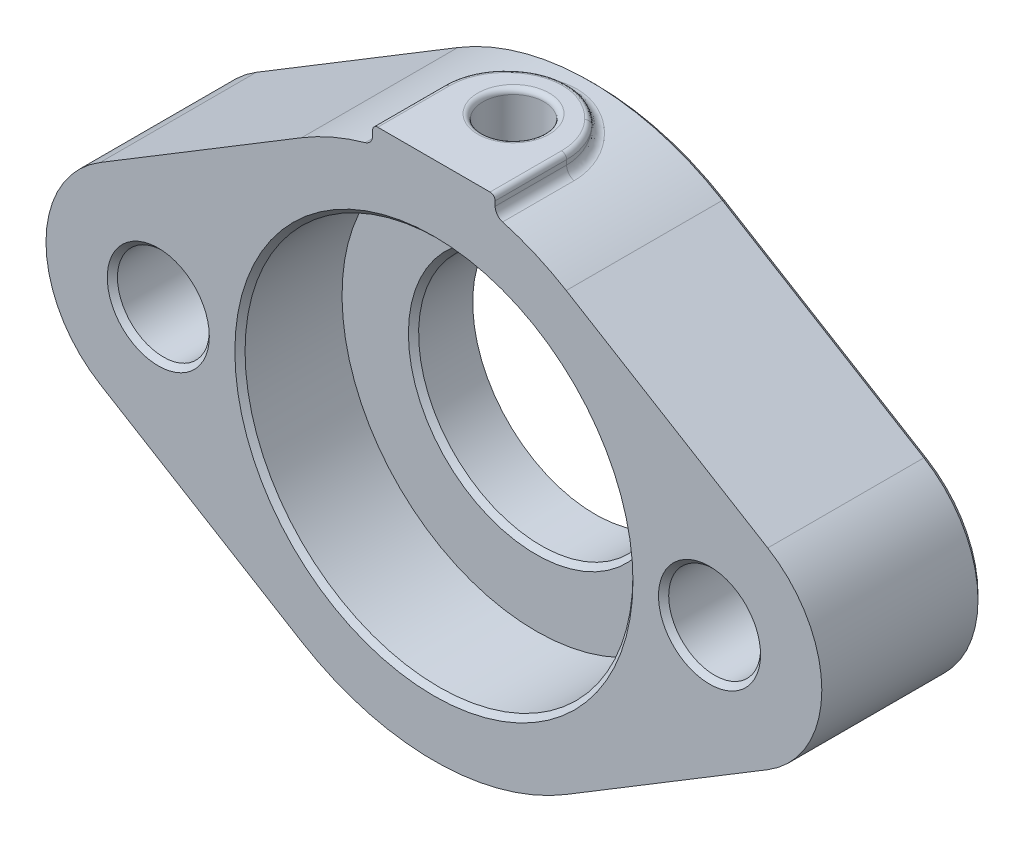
ISO-10303-21;
HEADER;
FILE_DESCRIPTION(('STEP AP214'),'2;1');
FILE_NAME('part.step','',(''),(''),'','','');
FILE_SCHEMA(('AUTOMOTIVE_DESIGN { 1 0 10303 214 1 1 1 1 }'));
ENDSEC;
DATA;
#1=APPLICATION_CONTEXT('core data for automotive mechanical design processes');
#2=APPLICATION_PROTOCOL_DEFINITION('international standard','automotive_design',2000,#1);
#3=PRODUCT_CONTEXT('',#1,'mechanical');
#4=PRODUCT('Part','Part','',(#3));
#5=PRODUCT_RELATED_PRODUCT_CATEGORY('part','',(#4));
#6=PRODUCT_DEFINITION_FORMATION('','',#4);
#7=PRODUCT_DEFINITION_CONTEXT('part definition',#1,'design');
#8=PRODUCT_DEFINITION('design','',#6,#7);
#9=PRODUCT_DEFINITION_SHAPE('','',#8);
#10=(LENGTH_UNIT() NAMED_UNIT(*) SI_UNIT(.MILLI.,.METRE.));
#11=(NAMED_UNIT(*) PLANE_ANGLE_UNIT() SI_UNIT($,.RADIAN.));
#12=(NAMED_UNIT(*) SI_UNIT($,.STERADIAN.) SOLID_ANGLE_UNIT());
#13=UNCERTAINTY_MEASURE_WITH_UNIT(LENGTH_MEASURE(1.E-05),#10,'distance_accuracy_value','');
#14=(GEOMETRIC_REPRESENTATION_CONTEXT(3) GLOBAL_UNCERTAINTY_ASSIGNED_CONTEXT((#13)) GLOBAL_UNIT_ASSIGNED_CONTEXT((#10,
#11,#12)) REPRESENTATION_CONTEXT('',''));
#15=CARTESIAN_POINT('',(0.,0.,0.));
#16=DIRECTION('',(0.,0.,1.));
#17=DIRECTION('',(1.,0.,0.));
#18=AXIS2_PLACEMENT_3D('',#15,#16,#17);
#19=CARTESIAN_POINT('',(2.2216747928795E-13,26.,8.80000000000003));
#20=DIRECTION('',(0.,-1.,0.));
#21=DIRECTION('',(0.,0.,-1.));
#22=AXIS2_PLACEMENT_3D('',#19,#20,#21);
#23=CYLINDRICAL_SURFACE('',#22,6.);
#24=CARTESIAN_POINT('',(-6.36737328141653,24.1755363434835,11.0689672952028));
#25=CARTESIAN_POINT('',(-5.6544945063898,24.3632949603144,10.8077643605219));
#26=CARTESIAN_POINT('',(-5.67605846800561,25.142557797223,10.7448291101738));
#27=CARTESIAN_POINT('',(-6.42730033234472,24.1597394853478,10.8871354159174));
#28=CARTESIAN_POINT('',(-5.71116595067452,24.3502455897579,10.6481374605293));
#29=CARTESIAN_POINT('',(-5.72947915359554,25.1261290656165,10.5889732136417));
#30=CARTESIAN_POINT('',(-6.48003560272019,24.1456243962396,10.7025798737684));
#31=CARTESIAN_POINT('',(-5.76124594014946,24.3385219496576,10.4853610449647));
#32=CARTESIAN_POINT('',(-5.77648888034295,25.1114493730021,10.4307827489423));
#33=CARTESIAN_POINT('',(-6.57077390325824,24.1210967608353,10.3293238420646));
#34=CARTESIAN_POINT('',(-5.84746280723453,24.3181238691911,10.1557431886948));
#35=CARTESIAN_POINT('',(-5.85737559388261,25.0859406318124,10.1108490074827));
#36=CARTESIAN_POINT('',(-6.60877623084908,24.1106843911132,10.1406231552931));
#37=CARTESIAN_POINT('',(-5.88367523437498,24.3094322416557,9.98877084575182));
#38=CARTESIAN_POINT('',(-5.89125195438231,25.0751117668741,9.94910556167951));
#39=CARTESIAN_POINT('',(-6.66965768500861,24.0939128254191,9.76062462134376));
#40=CARTESIAN_POINT('',(-5.94167303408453,24.295429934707,9.65228923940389));
#41=CARTESIAN_POINT('',(-5.94552342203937,25.0576693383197,9.62339253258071));
#42=CARTESIAN_POINT('',(-6.69255487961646,24.0875487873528,9.56933015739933));
#43=CARTESIAN_POINT('',(-5.96352957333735,24.2901023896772,9.48263389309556));
#44=CARTESIAN_POINT('',(-5.9659346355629,25.0510507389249,9.45942584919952));
#45=CARTESIAN_POINT('',(-6.72311627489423,24.0790347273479,9.18539080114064));
#46=CARTESIAN_POINT('',(-5.99268855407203,24.2829770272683,9.1420943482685));
#47=CARTESIAN_POINT('',(-5.99317793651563,25.0421961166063,9.13033497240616));
#48=CARTESIAN_POINT('',(-6.73078124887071,24.0768844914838,8.9927459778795));
#49=CARTESIAN_POINT('',(-6.00001960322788,24.2811722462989,8.9710492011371));
#50=CARTESIAN_POINT('',(-6.0000107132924,25.0399598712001,8.96521083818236));
#51=CARTESIAN_POINT('',(-6.7307451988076,24.0769080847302,8.41457607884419));
#52=CARTESIAN_POINT('',(-5.99996080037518,24.2811989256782,8.45796120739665));
#53=CARTESIAN_POINT('',(-5.99997857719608,25.0399844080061,8.46963663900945));
#54=CARTESIAN_POINT('',(-6.70002403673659,24.0855531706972,8.0287476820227));
#55=CARTESIAN_POINT('',(-5.97050769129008,24.2884742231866,8.1149084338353));
#56=CARTESIAN_POINT('',(-5.97259285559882,25.0489752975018,8.13892658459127));
#57=CARTESIAN_POINT('',(-6.57819756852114,24.119102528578,7.26867995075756));
#58=CARTESIAN_POINT('',(-5.85447257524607,24.3164767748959,7.44189727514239));
#59=CARTESIAN_POINT('',(-5.86399326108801,25.0838666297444,7.48743995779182));
#60=CARTESIAN_POINT('',(-6.4871048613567,24.1440034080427,6.89443821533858));
#61=CARTESIAN_POINT('',(-5.7674674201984,24.3373049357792,7.11073017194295));
#62=CARTESIAN_POINT('',(-5.78279061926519,25.1097635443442,7.16666132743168));
#63=CARTESIAN_POINT('',(-6.24778805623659,24.2070307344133,6.16807140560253));
#64=CARTESIAN_POINT('',(-5.54083326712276,24.3894433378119,6.47180057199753));
#65=CARTESIAN_POINT('',(-5.56945678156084,25.1753119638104,6.54406120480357));
#66=CARTESIAN_POINT('',(-6.09963392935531,24.2451409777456,5.81591985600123));
#67=CARTESIAN_POINT('',(-5.40051827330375,24.4209014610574,6.16315466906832));
#68=CARTESIAN_POINT('',(-5.43738795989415,25.2149466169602,6.24221701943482));
#69=CARTESIAN_POINT('',(-5.75059821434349,24.3302848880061,5.14231281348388));
#70=CARTESIAN_POINT('',(-5.07318513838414,24.4902826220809,5.57713554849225));
#71=CARTESIAN_POINT('',(-5.12624755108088,25.30349628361,5.66483955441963));
#72=CARTESIAN_POINT('',(-5.54969648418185,24.3773219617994,4.82086911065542));
#73=CARTESIAN_POINT('',(-4.88528251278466,24.5283564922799,5.29940462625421));
#74=CARTESIAN_POINT('',(-4.94715800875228,25.3524148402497,5.38931638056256));
#75=CARTESIAN_POINT('',(-5.09543787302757,24.4763486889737,4.20974530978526));
#76=CARTESIAN_POINT('',(-4.46496304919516,24.6073910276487,4.77578040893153));
#77=CARTESIAN_POINT('',(-4.54221890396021,25.455402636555,4.86549597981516));
#78=CARTESIAN_POINT('',(-4.84098360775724,24.5284271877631,3.92096279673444));
#79=CARTESIAN_POINT('',(-4.23088640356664,24.6484650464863,4.53098329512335));
#80=CARTESIAN_POINT('',(-4.31539110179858,25.5095642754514,4.6179681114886));
#81=CARTESIAN_POINT('',(-4.289227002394,24.6308980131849,3.39132524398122));
#82=CARTESIAN_POINT('',(-3.72922904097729,24.7280881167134,4.08605440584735));
#83=CARTESIAN_POINT('',(-3.82353949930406,25.6161339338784,4.16399306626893));
#84=CARTESIAN_POINT('',(-3.99192438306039,24.6812903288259,3.15047051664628));
#85=CARTESIAN_POINT('',(-3.46121522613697,24.7665999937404,3.8865430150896));
#86=CARTESIAN_POINT('',(-3.55851545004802,25.6685419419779,3.95754615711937));
#87=CARTESIAN_POINT('',(-3.35685794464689,24.7757154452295,2.71971012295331));
#88=CARTESIAN_POINT('',(-2.89504089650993,24.837801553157,3.53258937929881));
#89=CARTESIAN_POINT('',(-2.99239908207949,25.76674406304,3.58832296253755));
#90=CARTESIAN_POINT('',(-3.0185108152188,24.8196304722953,2.53070424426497));
#91=CARTESIAN_POINT('',(-2.59665338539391,24.8702318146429,3.37991980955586));
#92=CARTESIAN_POINT('',(-2.69078678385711,25.8124156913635,3.4263179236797));
#93=CARTESIAN_POINT('',(-2.31467458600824,24.8951272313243,2.21487256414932));
#94=CARTESIAN_POINT('',(-1.98165809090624,24.9254479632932,3.12619176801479));
#95=CARTESIAN_POINT('',(-2.06336705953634,25.890932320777,3.15560505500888));
#96=CARTESIAN_POINT('',(-1.94918944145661,24.9267107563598,2.08803772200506));
#97=CARTESIAN_POINT('',(-1.66587027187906,24.9480400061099,3.02610177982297));
#98=CARTESIAN_POINT('',(-1.73756315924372,25.9237791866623,3.04688947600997));
#99=CARTESIAN_POINT('',(-1.21051312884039,24.9733529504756,1.90307932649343));
#100=CARTESIAN_POINT('',(-1.03093602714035,24.9813106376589,2.88022910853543));
#101=CARTESIAN_POINT('',(-1.07908598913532,25.972287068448,2.8883537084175));
#102=CARTESIAN_POINT('',(-0.837700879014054,24.9887800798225,1.84342124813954));
#103=CARTESIAN_POINT('',(-0.713314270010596,24.9921088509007,2.83388771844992));
#104=CARTESIAN_POINT('',(-0.746750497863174,25.9883312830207,2.83721821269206));
#105=CARTESIAN_POINT('',(-0.0874485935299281,25.002660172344,1.78968013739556));
#106=CARTESIAN_POINT('',(-0.0739477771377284,25.001881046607,2.7919076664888));
#107=CARTESIAN_POINT('',(-0.0779541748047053,26.0027665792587,2.79115440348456));
#108=CARTESIAN_POINT('',(0.289990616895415,25.0011161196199,1.79558557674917));
#109=CARTESIAN_POINT('',(0.246193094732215,25.0008081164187,2.79647036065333));
#110=CARTESIAN_POINT('',(0.258505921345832,26.0011607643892,2.79621620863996));
#111=CARTESIAN_POINT('',(1.02851315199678,24.9814971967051,1.87172666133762));
#112=CARTESIAN_POINT('',(0.876143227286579,24.9869757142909,2.85601175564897));
#113=CARTESIAN_POINT('',(0.916846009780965,25.9807570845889,2.86147999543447));
#114=CARTESIAN_POINT('',(1.3897675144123,24.9638482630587,1.94030482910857));
#115=CARTESIAN_POINT('',(1.1845099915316,24.9745825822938,2.90941042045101));
#116=CARTESIAN_POINT('',(1.23887846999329,25.9624021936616,2.92026128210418));
#117=CARTESIAN_POINT('',(2.09588340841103,24.9145061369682,2.1371651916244));
#118=CARTESIAN_POINT('',(1.79274288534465,24.9392743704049,3.06503808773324));
#119=CARTESIAN_POINT('',(1.86833035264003,25.9110863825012,3.08899873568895));
#120=CARTESIAN_POINT('',(2.44074387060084,24.8828120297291,2.26545127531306));
#121=CARTESIAN_POINT('',(2.09146453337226,24.9165035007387,3.16661413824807));
#122=CARTESIAN_POINT('',(2.17574882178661,25.8781245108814,3.1989582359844));
#123=CARTESIAN_POINT('',(3.10833673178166,24.8083111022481,2.57935102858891));
#124=CARTESIAN_POINT('',(2.67588438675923,24.8618608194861,3.41931545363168));
#125=CARTESIAN_POINT('',(2.77086017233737,25.8006435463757,3.46801516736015));
#126=CARTESIAN_POINT('',(3.43081043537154,24.765395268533,2.76553066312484));
#127=CARTESIAN_POINT('',(2.9607904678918,24.8300679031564,3.57007236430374));
#128=CARTESIAN_POINT('',(3.05832244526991,25.7560110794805,3.62759771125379));
#129=CARTESIAN_POINT('',(4.04166039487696,24.6730733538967,3.18947841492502));
#130=CARTESIAN_POINT('',(3.50601307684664,24.7603248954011,3.91888650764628));
#131=CARTESIAN_POINT('',(3.60285155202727,25.6599962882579,3.99098149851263));
#132=CARTESIAN_POINT('',(4.33003197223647,24.6236663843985,3.42725359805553));
#133=CARTESIAN_POINT('',(3.76624266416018,24.7224996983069,4.11611722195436));
#134=CARTESIAN_POINT('',(3.85991421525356,25.6086130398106,4.1947887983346));
#135=CARTESIAN_POINT('',(4.87399144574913,24.5218932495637,3.95641518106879));
#136=CARTESIAN_POINT('',(4.26108382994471,24.6433432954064,4.56093460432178));
#137=CARTESIAN_POINT('',(4.3448152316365,25.5027689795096,4.64835586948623));
#138=CARTESIAN_POINT('',(5.12827949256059,24.4694828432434,4.24923995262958));
#139=CARTESIAN_POINT('',(4.49520303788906,24.6019558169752,4.80938186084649));
#140=CARTESIAN_POINT('',(4.5714948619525,25.4482621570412,4.8993485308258));
#141=CARTESIAN_POINT('',(5.58643050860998,24.3689752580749,4.875684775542));
#142=CARTESIAN_POINT('',(4.91937678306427,24.5216594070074,5.34650251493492));
#143=CARTESIAN_POINT('',(4.97990376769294,25.3437342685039,5.43630123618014));
#144=CARTESIAN_POINT('',(5.79027246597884,24.3208798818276,5.209321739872));
#145=CARTESIAN_POINT('',(5.11025064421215,24.4826651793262,5.63507016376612));
#146=CARTESIAN_POINT('',(5.16161431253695,25.2937150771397,5.7222757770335));
#147=CARTESIAN_POINT('',(6.14282087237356,24.2342567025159,5.91136107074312));
#148=CARTESIAN_POINT('',(5.44115696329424,24.4119847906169,6.24644420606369));
#149=CARTESIAN_POINT('',(5.47588603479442,25.2036269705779,6.32402377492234));
#150=CARTESIAN_POINT('',(6.29112869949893,24.1957987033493,6.27999183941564));
#151=CARTESIAN_POINT('',(5.58179914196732,24.3801800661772,6.56995590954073));
#152=CARTESIAN_POINT('',(5.60809186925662,25.1636306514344,6.63999300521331));
#153=CARTESIAN_POINT('',(6.46682854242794,24.1491957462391,6.84873984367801));
#154=CARTESIAN_POINT('',(5.74865423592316,24.3415020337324,7.07161564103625));
#155=CARTESIAN_POINT('',(5.76471572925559,25.1151635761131,7.12749129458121));
#156=CARTESIAN_POINT('',(6.51759187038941,24.1355116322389,7.04088583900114));
#157=CARTESIAN_POINT('',(5.79691926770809,24.330117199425,7.24124456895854));
#158=CARTESIAN_POINT('',(5.80996761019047,25.100932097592,7.29218786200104));
#159=CARTESIAN_POINT('',(6.60322237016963,24.1122264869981,7.42920630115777));
#160=CARTESIAN_POINT('',(5.8783522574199,24.3107278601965,7.58445035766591));
#161=CARTESIAN_POINT('',(5.88630108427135,25.0767155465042,7.62503397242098));
#162=CARTESIAN_POINT('',(6.63809722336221,24.1026234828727,7.62537877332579));
#163=CARTESIAN_POINT('',(5.91160575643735,24.3027036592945,7.7581760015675));
#164=CARTESIAN_POINT('',(5.91738952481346,25.0667284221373,7.79318180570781));
#165=CARTESIAN_POINT('',(6.68679592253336,24.089152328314,7.98459625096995));
#166=CARTESIAN_POINT('',(5.95803009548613,24.2914455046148,8.07650268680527));
#167=CARTESIAN_POINT('',(5.96080093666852,25.0527184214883,8.10108250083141));
#168=CARTESIAN_POINT('',(6.70328310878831,24.0845619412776,8.14723001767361));
#169=CARTESIAN_POINT('',(5.97376844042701,24.2876021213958,8.22076619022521));
#170=CARTESIAN_POINT('',(5.97549808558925,25.0479444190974,8.24048287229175));
#171=CARTESIAN_POINT('',(6.72526577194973,24.0784329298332,8.4732397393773));
#172=CARTESIAN_POINT('',(5.99474259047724,24.2824724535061,8.50996829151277));
#173=CARTESIAN_POINT('',(5.99509405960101,25.0415702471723,8.51991977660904));
#174=CARTESIAN_POINT('',(6.73076969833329,24.076891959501,8.63661502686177));
#175=CARTESIAN_POINT('',(6.00000092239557,24.2811806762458,8.65500511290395));
#176=CARTESIAN_POINT('',(6.00000041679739,25.0399676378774,8.6599557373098));
#177=CARTESIAN_POINT('',(6.73076868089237,24.0768928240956,8.99214836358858));
#178=CARTESIAN_POINT('',(5.9999989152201,24.2811816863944,8.97052077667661));
#179=CARTESIAN_POINT('',(5.99999950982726,25.0399685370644,8.96469859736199));
#180=CARTESIAN_POINT('',(6.7231550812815,24.0790251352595,9.18431012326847));
#181=CARTESIAN_POINT('',(5.99272334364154,24.2829696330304,9.14113517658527));
#182=CARTESIAN_POINT('',(5.99321252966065,25.0421861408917,9.12940867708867));
#183=CARTESIAN_POINT('',(6.69276084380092,24.0874902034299,9.56733088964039));
#184=CARTESIAN_POINT('',(5.96372845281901,24.2900526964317,9.48085996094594));
#185=CARTESIAN_POINT('',(5.96611823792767,25.0509898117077,9.45771219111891));
#186=CARTESIAN_POINT('',(6.66997174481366,24.093825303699,9.75818910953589));
#187=CARTESIAN_POINT('',(5.94197345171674,24.2953564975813,9.65012950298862));
#188=CARTESIAN_POINT('',(5.9458033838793,25.0575783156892,9.62130495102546));
#189=CARTESIAN_POINT('',(6.6092240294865,24.1105620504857,10.1382991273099));
#190=CARTESIAN_POINT('',(5.88410079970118,24.3093304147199,9.98671544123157));
#191=CARTESIAN_POINT('',(5.89165113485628,25.0749845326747,9.94711353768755));
#192=CARTESIAN_POINT('',(6.57117211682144,24.1209886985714,10.3275335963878));
#193=CARTESIAN_POINT('',(5.84784084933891,24.3180340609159,10.154162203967));
#194=CARTESIAN_POINT('',(5.85773057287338,25.0858282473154,10.1093145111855));
#195=CARTESIAN_POINT('',(6.48027468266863,24.1455601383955,10.701747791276));
#196=CARTESIAN_POINT('',(5.76147308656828,24.3384685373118,10.4846283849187));
#197=CARTESIAN_POINT('',(5.77670200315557,25.1113825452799,10.4300695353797));
#198=CARTESIAN_POINT('',(6.42743695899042,24.1597029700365,10.8867297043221));
#199=CARTESIAN_POINT('',(5.71129582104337,24.3502152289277,10.6477819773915));
#200=CARTESIAN_POINT('',(5.72960094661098,25.126091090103,10.5886254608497));
#201=CARTESIAN_POINT('',(6.36737328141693,24.1755363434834,11.0689672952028));
#202=CARTESIAN_POINT('',(5.65449450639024,24.3632949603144,10.8077643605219));
#203=CARTESIAN_POINT('',(5.67605846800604,25.142557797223,10.7448291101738));
#204=(BOUNDED_SURFACE() B_SPLINE_SURFACE(3,2,((#24,#25,#26),(#27,#28,#29),(#30,#31,#32),(#33,
#34,#35),(#36,#37,#38),(#39,#40,#41),(#42,#43,#44),(#45,#46,#47),(#48,#49,#50),(#51,#52,#53),
(#54,#55,#56),(#57,#58,#59),(#60,#61,#62),(#63,#64,#65),(#66,#67,#68),(#69,#70,#71),(#72,#73,
#74),(#75,#76,#77),(#78,#79,#80),(#81,#82,#83),(#84,#85,#86),(#87,#88,#89),(#90,#91,#92),(#93,
#94,#95),(#96,#97,#98),(#99,#100,#101),(#102,#103,#104),(#105,#106,#107),(#108,#109,#110),(#111,
#112,#113),(#114,#115,#116),(#117,#118,#119),(#120,#121,#122),(#123,#124,#125),(#126,#127,#128),
(#129,#130,#131),(#132,#133,#134),(#135,#136,#137),(#138,#139,#140),(#141,#142,#143),(#144,#145,
#146),(#147,#148,#149),(#150,#151,#152),(#153,#154,#155),(#156,#157,#158),(#159,#160,#161),
(#162,#163,#164),(#165,#166,#167),(#168,#169,#170),(#171,#172,#173),(#174,#175,#176),(#177,#178,
#179),(#180,#181,#182),(#183,#184,#185),(#186,#187,#188),(#189,#190,#191),(#192,#193,#194),
(#195,#196,#197),(#198,#199,#200),(#201,#202,#203)),.UNSPECIFIED.,.F.,.F.,
.F.) B_SPLINE_SURFACE_WITH_KNOTS((4,2,2,2,2,2,2,2,2,2,2,2,2,2,2,2,2,2,2,2,2,2,2,2,2,2,2,2,2,4),
(3,3),(0.,0.578581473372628,1.15719053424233,1.73510622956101,2.31299258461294,3.46856131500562,
4.62388896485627,5.7778043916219,6.93216109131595,8.11299303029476,9.29383266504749,
10.4940268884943,11.6940465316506,12.8660596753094,14.0378667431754,15.1795530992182,
16.3213138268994,17.4746072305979,18.6280586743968,19.8174134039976,21.0072626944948,
22.2054960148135,22.8041919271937,23.4025980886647,23.8930014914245,24.3830274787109,
24.9593209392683,25.5359359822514,26.1161307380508,26.6960200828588),(0.,1.),
.UNSPECIFIED.) GEOMETRIC_REPRESENTATION_ITEM() RATIONAL_B_SPLINE_SURFACE(((1.,0.787700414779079,
1.),(1.,0.789140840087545,1.),(1.,0.790422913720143,1.),(1.,0.792645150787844,1.),(1.,
0.79358529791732,1.),(1.,0.795097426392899,1.),(1.,0.795669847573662,1.),(1.,0.796435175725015,
1.),(1.,0.79662810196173,1.),(1.,0.796626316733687,1.),(1.,0.79585131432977,1.),(1.,
0.792826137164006,1.),(1.,0.790576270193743,1.),(1.,0.784828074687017,1.),(1.,0.781331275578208,
1.),(1.,0.773426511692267,1.),(1.,0.769018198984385,1.),(1.,0.759614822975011,1.),(1.,
0.75460862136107,1.),(1.,0.744624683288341,1.),(1.,0.739646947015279,1.),(1.,0.730207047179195,
1.),(1.,0.725754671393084,1.),(1.,0.718030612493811,1.),(1.,0.71475875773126,1.),(1.,
0.709904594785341,1.),(1.,0.708284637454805,1.),(1.,0.706827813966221,1.),(1.,0.706990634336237,
1.),(1.,0.709048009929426,1.),(1.,0.710897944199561,1.),(1.,0.716022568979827,1.),(1.,
0.719297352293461,1.),(1.,0.726903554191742,1.),(1.,0.731245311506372,1.),(1.,0.740460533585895,
1.),(1.,0.745334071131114,1.),(1.,0.755239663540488,1.),(1.,0.760271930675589,1.),(1.,
0.769804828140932,1.),(1.,0.77430523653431,1.),(1.,0.78233460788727,1.),(1.,0.785856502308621,
1.),(1.,0.790099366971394,1.),(1.,0.791340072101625,1.),(1.,0.793446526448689,1.),(1.,
0.794312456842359,1.),(1.,0.795525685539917,1.),(1.,0.795938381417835,1.),(1.,0.796489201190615,
1.),(1.,0.796627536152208,1.),(1.,0.796627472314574,1.),(1.,0.796436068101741,1.),(1.,
0.795675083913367,1.),(1.,0.795105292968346,1.),(1.,0.793596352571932,1.),(1.,0.792654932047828,
1.),(1.,0.790428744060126,1.),(1.,0.78914415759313,1.),(1.,0.787700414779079,1.))) REPRESENTATION_ITEM('') SURFACE());
#205=CARTESIAN_POINT('',(5.67605846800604,25.142557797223,10.7448291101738));
#206=CARTESIAN_POINT('',(5.72960094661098,25.126091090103,10.5886254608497));
#207=CARTESIAN_POINT('',(5.77670200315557,25.1113825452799,10.4300695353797));
#208=CARTESIAN_POINT('',(5.85773057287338,25.0858282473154,10.1093145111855));
#209=CARTESIAN_POINT('',(5.89165113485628,25.0749845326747,9.94711353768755));
#210=CARTESIAN_POINT('',(5.9458033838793,25.0575783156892,9.62130495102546));
#211=CARTESIAN_POINT('',(5.96611823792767,25.0509898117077,9.45771219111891));
#212=CARTESIAN_POINT('',(5.99321252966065,25.0421861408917,9.12940867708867));
#213=CARTESIAN_POINT('',(5.99999950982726,25.0399685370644,8.96469859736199));
#214=CARTESIAN_POINT('',(6.00000041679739,25.0399676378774,8.6599557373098));
#215=CARTESIAN_POINT('',(5.99509405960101,25.0415702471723,8.51991977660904));
#216=CARTESIAN_POINT('',(5.97549808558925,25.0479444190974,8.24048287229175));
#217=CARTESIAN_POINT('',(5.96080093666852,25.0527184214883,8.10108250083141));
#218=CARTESIAN_POINT('',(5.91738952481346,25.0667284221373,7.79318180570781));
#219=CARTESIAN_POINT('',(5.88630108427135,25.0767155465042,7.62503397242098));
#220=CARTESIAN_POINT('',(5.80996761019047,25.100932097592,7.29218786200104));
#221=CARTESIAN_POINT('',(5.76471572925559,25.1151635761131,7.12749129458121));
#222=CARTESIAN_POINT('',(5.60809186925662,25.1636306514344,6.63999300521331));
#223=CARTESIAN_POINT('',(5.47588603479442,25.2036269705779,6.32402377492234));
#224=CARTESIAN_POINT('',(5.16161431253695,25.2937150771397,5.7222757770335));
#225=CARTESIAN_POINT('',(4.97990376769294,25.3437342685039,5.43630123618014));
#226=CARTESIAN_POINT('',(4.5714948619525,25.4482621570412,4.8993485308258));
#227=CARTESIAN_POINT('',(4.3448152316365,25.5027689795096,4.64835586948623));
#228=CARTESIAN_POINT('',(3.85991421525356,25.6086130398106,4.1947887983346));
#229=CARTESIAN_POINT('',(3.60285155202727,25.6599962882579,3.99098149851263));
#230=CARTESIAN_POINT('',(3.05832244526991,25.7560110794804,3.62759771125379));
#231=CARTESIAN_POINT('',(2.77086017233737,25.8006435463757,3.46801516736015));
#232=CARTESIAN_POINT('',(2.17574882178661,25.8781245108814,3.1989582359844));
#233=CARTESIAN_POINT('',(1.86833035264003,25.9110863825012,3.08899873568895));
#234=CARTESIAN_POINT('',(1.23887846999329,25.9624021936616,2.92026128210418));
#235=CARTESIAN_POINT('',(0.916846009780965,25.9807570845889,2.86147999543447));
#236=CARTESIAN_POINT('',(0.258505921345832,26.0011607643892,2.79621620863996));
#237=CARTESIAN_POINT('',(-0.0779541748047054,26.0027665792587,2.79115440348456));
#238=CARTESIAN_POINT('',(-0.746750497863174,25.9883312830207,2.83721821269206));
#239=CARTESIAN_POINT('',(-1.07908598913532,25.972287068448,2.8883537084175));
#240=CARTESIAN_POINT('',(-1.73756315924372,25.9237791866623,3.04688947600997));
#241=CARTESIAN_POINT('',(-2.06336705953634,25.890932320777,3.15560505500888));
#242=CARTESIAN_POINT('',(-2.69078678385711,25.8124156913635,3.4263179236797));
#243=CARTESIAN_POINT('',(-2.99239908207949,25.76674406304,3.58832296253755));
#244=CARTESIAN_POINT('',(-3.55851545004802,25.6685419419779,3.95754615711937));
#245=CARTESIAN_POINT('',(-3.82353949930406,25.6161339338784,4.16399306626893));
#246=CARTESIAN_POINT('',(-4.31539110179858,25.5095642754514,4.6179681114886));
#247=CARTESIAN_POINT('',(-4.54221890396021,25.455402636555,4.86549597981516));
#248=CARTESIAN_POINT('',(-4.94715800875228,25.3524148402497,5.38931638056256));
#249=CARTESIAN_POINT('',(-5.12624755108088,25.30349628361,5.66483955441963));
#250=CARTESIAN_POINT('',(-5.43738795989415,25.2149466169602,6.24221701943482));
#251=CARTESIAN_POINT('',(-5.56945678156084,25.1753119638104,6.54406120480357));
#252=CARTESIAN_POINT('',(-5.78279061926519,25.1097635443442,7.16666132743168));
#253=CARTESIAN_POINT('',(-5.86399326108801,25.0838666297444,7.48743995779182));
#254=CARTESIAN_POINT('',(-5.97259285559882,25.0489752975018,8.13892658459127));
#255=CARTESIAN_POINT('',(-5.99997857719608,25.0399844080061,8.46963663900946));
#256=CARTESIAN_POINT('',(-6.0000107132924,25.0399598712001,8.96521083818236));
#257=CARTESIAN_POINT('',(-5.99317793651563,25.0421961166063,9.13033497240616));
#258=CARTESIAN_POINT('',(-5.9659346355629,25.0510507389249,9.45942584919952));
#259=CARTESIAN_POINT('',(-5.94552342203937,25.0576693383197,9.62339253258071));
#260=CARTESIAN_POINT('',(-5.89125195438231,25.0751117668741,9.94910556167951));
#261=CARTESIAN_POINT('',(-5.85737559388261,25.0859406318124,10.1108490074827));
#262=CARTESIAN_POINT('',(-5.77648888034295,25.1114493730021,10.4307827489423));
#263=CARTESIAN_POINT('',(-5.72947915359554,25.1261290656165,10.5889732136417));
#264=CARTESIAN_POINT('',(-5.67605846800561,25.142557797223,10.7448291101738));
#265=B_SPLINE_CURVE_WITH_KNOTS('',3,(#205,#206,#207,#208,#209,#210,#211,#212,#213,#214,#215,
#216,#217,#218,#219,#220,#221,#222,#223,#224,#225,#226,#227,#228,#229,#230,#231,#232,#233,#234,
#235,#236,#237,#238,#239,#240,#241,#242,#243,#244,#245,#246,#247,#248,#249,#250,#251,#252,#253,
#254,#255,#256,#257,#258,#259,#260,#261,#262,#263,#264),.UNSPECIFIED.,.F.,.F.,(4,2,2,2,2,2,2,2,
2,2,2,2,2,2,2,2,2,2,2,2,2,2,2,2,2,2,2,2,2,4),(0.,0.57988934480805,1.16008410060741,
1.73669914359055,2.31299260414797,2.80301859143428,3.29342199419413,3.89182815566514,
4.49052406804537,5.68875738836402,6.87860667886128,8.06796140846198,9.22141285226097,
10.3747062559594,11.5164669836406,12.6581533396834,13.8299604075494,15.0019735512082,
16.2019931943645,17.4021874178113,18.5830270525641,19.7638589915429,20.9182156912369,
22.0721311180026,23.2274587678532,24.3830274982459,24.9609138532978,25.5388295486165,
26.1174386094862,26.6960200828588),.UNSPECIFIED.);
#266=CARTESIAN_POINT('',(6.00000000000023,25.0399680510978,8.80000000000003));
#267=VERTEX_POINT('',#266);
#268=CARTESIAN_POINT('',(4.3495249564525,25.5000000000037,4.66700681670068));
#269=VERTEX_POINT('',#268);
#270=EDGE_CURVE('E861',#267,#269,#265,.T.);
#271=ORIENTED_EDGE('',*,*,#270,.T.);
#272=CARTESIAN_POINT('',(2.17587809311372E-13,25.5,8.80000000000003));
#273=DIRECTION('',(0.,1.,0.));
#274=DIRECTION('',(0.,0.,1.));
#275=AXIS2_PLACEMENT_3D('',#272,#273,#274);
#276=CIRCLE('',#275,6.);
#277=CARTESIAN_POINT('',(6.00000000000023,25.5,8.80000000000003));
#278=VERTEX_POINT('',#277);
#279=EDGE_CURVE('E941',#269,#278,#276,.F.);
#280=ORIENTED_EDGE('',*,*,#279,.T.);
#281=DIRECTION('',(0.,-1.,0.));
#282=VECTOR('',#281,1.);
#283=CARTESIAN_POINT('',(6.00000000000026,26.,8.80000000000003));
#284=LINE('',#283,#282);
#285=EDGE_CURVE('E628',#278,#267,#284,.T.);
#286=ORIENTED_EDGE('',*,*,#285,.T.);
#287=EDGE_LOOP('',(#271,#280,#286));
#288=FACE_BOUND('',#287,.T.);
#289=ADVANCED_FACE('F348',(#288),#23,.T.);
#290=CARTESIAN_POINT('',(0.,-2.28983498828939E-13,15.8));
#291=DIRECTION('',(0.,0.,-1.));
#292=DIRECTION('',(-1.,0.,0.));
#293=AXIS2_PLACEMENT_3D('',#290,#291,#292);
#294=CYLINDRICAL_SURFACE('',#293,25.);
#295=CARTESIAN_POINT('',(-6.36737328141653,24.1755363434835,11.0689672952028));
#296=CARTESIAN_POINT('',(-6.42730033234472,24.1597394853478,10.8871354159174));
#297=CARTESIAN_POINT('',(-6.48003560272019,24.1456243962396,10.7025798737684));
#298=CARTESIAN_POINT('',(-6.57077390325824,24.1210967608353,10.3293238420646));
#299=CARTESIAN_POINT('',(-6.60877623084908,24.1106843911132,10.1406231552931));
#300=CARTESIAN_POINT('',(-6.66965768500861,24.0939128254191,9.76062462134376));
#301=CARTESIAN_POINT('',(-6.69255487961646,24.0875487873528,9.56933015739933));
#302=CARTESIAN_POINT('',(-6.72311627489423,24.0790347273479,9.18539080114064));
#303=CARTESIAN_POINT('',(-6.73078124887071,24.0768844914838,8.9927459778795));
#304=CARTESIAN_POINT('',(-6.7307451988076,24.0769080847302,8.4145760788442));
#305=CARTESIAN_POINT('',(-6.70002403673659,24.0855531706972,8.0287476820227));
#306=CARTESIAN_POINT('',(-6.57819756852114,24.119102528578,7.26867995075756));
#307=CARTESIAN_POINT('',(-6.4871048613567,24.1440034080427,6.89443821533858));
#308=CARTESIAN_POINT('',(-6.24778805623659,24.2070307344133,6.16807140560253));
#309=CARTESIAN_POINT('',(-6.09963392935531,24.2451409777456,5.81591985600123));
#310=CARTESIAN_POINT('',(-5.75059821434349,24.3302848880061,5.14231281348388));
#311=CARTESIAN_POINT('',(-5.54969648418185,24.3773219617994,4.82086911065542));
#312=CARTESIAN_POINT('',(-5.09543787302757,24.4763486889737,4.20974530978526));
#313=CARTESIAN_POINT('',(-4.84098360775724,24.5284271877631,3.92096279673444));
#314=CARTESIAN_POINT('',(-4.289227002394,24.6308980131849,3.39132524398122));
#315=CARTESIAN_POINT('',(-3.99192438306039,24.6812903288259,3.15047051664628));
#316=CARTESIAN_POINT('',(-3.35685794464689,24.7757154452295,2.71971012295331));
#317=CARTESIAN_POINT('',(-3.0185108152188,24.8196304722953,2.53070424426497));
#318=CARTESIAN_POINT('',(-2.31467458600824,24.8951272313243,2.21487256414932));
#319=CARTESIAN_POINT('',(-1.94918944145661,24.9267107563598,2.08803772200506));
#320=CARTESIAN_POINT('',(-1.21051312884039,24.9733529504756,1.90307932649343));
#321=CARTESIAN_POINT('',(-0.837700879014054,24.9887800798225,1.84342124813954));
#322=CARTESIAN_POINT('',(-0.0874485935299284,25.002660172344,1.78968013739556));
#323=CARTESIAN_POINT('',(0.289990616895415,25.0011161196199,1.79558557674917));
#324=CARTESIAN_POINT('',(1.02851315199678,24.9814971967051,1.87172666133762));
#325=CARTESIAN_POINT('',(1.3897675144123,24.9638482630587,1.94030482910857));
#326=CARTESIAN_POINT('',(2.09588340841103,24.9145061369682,2.1371651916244));
#327=CARTESIAN_POINT('',(2.44074387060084,24.8828120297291,2.26545127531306));
#328=CARTESIAN_POINT('',(3.10833673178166,24.8083111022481,2.57935102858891));
#329=CARTESIAN_POINT('',(3.43081043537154,24.765395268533,2.76553066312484));
#330=CARTESIAN_POINT('',(4.04166039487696,24.6730733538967,3.18947841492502));
#331=CARTESIAN_POINT('',(4.33003197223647,24.6236663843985,3.42725359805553));
#332=CARTESIAN_POINT('',(4.87399144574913,24.5218932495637,3.95641518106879));
#333=CARTESIAN_POINT('',(5.12827949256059,24.4694828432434,4.24923995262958));
#334=CARTESIAN_POINT('',(5.58643050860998,24.3689752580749,4.875684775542));
#335=CARTESIAN_POINT('',(5.79027246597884,24.3208798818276,5.209321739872));
#336=CARTESIAN_POINT('',(6.14282087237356,24.2342567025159,5.91136107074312));
#337=CARTESIAN_POINT('',(6.29112869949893,24.1957987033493,6.27999183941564));
#338=CARTESIAN_POINT('',(6.46682854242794,24.1491957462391,6.84873984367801));
#339=CARTESIAN_POINT('',(6.51759187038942,24.1355116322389,7.04088583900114));
#340=CARTESIAN_POINT('',(6.60322237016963,24.1122264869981,7.42920630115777));
#341=CARTESIAN_POINT('',(6.63809722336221,24.1026234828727,7.62537877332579));
#342=CARTESIAN_POINT('',(6.68679592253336,24.089152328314,7.98459625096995));
#343=CARTESIAN_POINT('',(6.70328310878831,24.0845619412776,8.14723001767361));
#344=CARTESIAN_POINT('',(6.72526577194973,24.0784329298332,8.4732397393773));
#345=CARTESIAN_POINT('',(6.73076969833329,24.076891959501,8.63661502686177));
#346=CARTESIAN_POINT('',(6.73076868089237,24.0768928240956,8.99214836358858));
#347=CARTESIAN_POINT('',(6.7231550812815,24.0790251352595,9.18431012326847));
#348=CARTESIAN_POINT('',(6.69276084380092,24.0874902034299,9.56733088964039));
#349=CARTESIAN_POINT('',(6.66997174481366,24.093825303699,9.75818910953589));
#350=CARTESIAN_POINT('',(6.6092240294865,24.1105620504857,10.1382991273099));
#351=CARTESIAN_POINT('',(6.57117211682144,24.1209886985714,10.3275335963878));
#352=CARTESIAN_POINT('',(6.48027468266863,24.1455601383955,10.701747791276));
#353=CARTESIAN_POINT('',(6.42743695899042,24.1597029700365,10.8867297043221));
#354=CARTESIAN_POINT('',(6.36737328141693,24.1755363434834,11.0689672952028));
#355=B_SPLINE_CURVE_WITH_KNOTS('',3,(#295,#296,#297,#298,#299,#300,#301,#302,#303,#304,#305,
#306,#307,#308,#309,#310,#311,#312,#313,#314,#315,#316,#317,#318,#319,#320,#321,#322,#323,#324,
#325,#326,#327,#328,#329,#330,#331,#332,#333,#334,#335,#336,#337,#338,#339,#340,#341,#342,#343,
#344,#345,#346,#347,#348,#349,#350,#351,#352,#353,#354),.UNSPECIFIED.,.F.,.F.,(4,2,2,2,2,2,2,2,
2,2,2,2,2,2,2,2,2,2,2,2,2,2,2,2,2,2,2,2,2,4),(0.,0.578581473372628,1.15719053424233,
1.73510622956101,2.31299258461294,3.46856131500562,4.62388896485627,5.7778043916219,
6.93216109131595,8.11299303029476,9.29383266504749,10.4940268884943,11.6940465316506,
12.8660596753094,14.0378667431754,15.1795530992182,16.3213138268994,17.4746072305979,
18.6280586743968,19.8174134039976,21.0072626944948,22.2054960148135,22.8041919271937,
23.4025980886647,23.8930014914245,24.3830274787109,24.9593209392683,25.5359359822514,
26.1161307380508,26.6960200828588),.UNSPECIFIED.);
#356=CARTESIAN_POINT('',(-6.730769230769,24.0768923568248,8.79999999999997));
#357=VERTEX_POINT('',#356);
#358=CARTESIAN_POINT('',(6.73076923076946,24.0768923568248,8.80000000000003));
#359=VERTEX_POINT('',#358);
#360=EDGE_CURVE('E848',#357,#359,#355,.T.);
#361=ORIENTED_EDGE('',*,*,#360,.T.);
#362=DIRECTION('',(0.,0.,-1.));
#363=VECTOR('',#362,1.);
#364=CARTESIAN_POINT('',(6.73076923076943,24.0768923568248,15.8));
#365=LINE('',#364,#363);
#366=CARTESIAN_POINT('',(6.73076923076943,24.0768923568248,15.8));
#367=VERTEX_POINT('',#366);
#368=EDGE_CURVE('E854',#359,#367,#365,.F.);
#369=ORIENTED_EDGE('',*,*,#368,.T.);
#370=CARTESIAN_POINT('',(0.,-2.28983498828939E-13,15.8));
#371=DIRECTION('',(0.,0.,1.));
#372=DIRECTION('',(1.,0.,0.));
#373=AXIS2_PLACEMENT_3D('',#370,#371,#372);
#374=CIRCLE('',#373,25.);
#375=CARTESIAN_POINT('',(12.9629629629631,21.3766599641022,15.8));
#376=VERTEX_POINT('',#375);
#377=EDGE_CURVE('E675',#376,#367,#374,.T.);
#378=ORIENTED_EDGE('',*,*,#377,.F.);
#379=DIRECTION('',(0.,0.,-1.));
#380=VECTOR('',#379,1.);
#381=CARTESIAN_POINT('',(12.9629629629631,21.3766599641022,15.8));
#382=LINE('',#381,#380);
#383=CARTESIAN_POINT('',(12.9629629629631,21.3766599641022,0.5));
#384=VERTEX_POINT('',#383);
#385=EDGE_CURVE('E692',#376,#384,#382,.T.);
#386=ORIENTED_EDGE('',*,*,#385,.T.);
#387=CARTESIAN_POINT('',(0.,0.,0.5));
#388=DIRECTION('',(0.,0.,1.));
#389=DIRECTION('',(1.,0.,0.));
#390=AXIS2_PLACEMENT_3D('',#387,#388,#389);
#391=CIRCLE('',#390,25.);
#392=CARTESIAN_POINT('',(-12.9629629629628,21.3766599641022,0.5));
#393=VERTEX_POINT('',#392);
#394=EDGE_CURVE('E736',#384,#393,#391,.T.);
#395=ORIENTED_EDGE('',*,*,#394,.T.);
#396=DIRECTION('',(0.,0.,-1.));
#397=VECTOR('',#396,1.);
#398=CARTESIAN_POINT('',(-12.9629629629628,21.3766599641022,15.8));
#399=LINE('',#398,#397);
#400=CARTESIAN_POINT('',(-12.9629629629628,21.3766599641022,15.8));
#401=VERTEX_POINT('',#400);
#402=EDGE_CURVE('E713',#401,#393,#399,.T.);
#403=ORIENTED_EDGE('',*,*,#402,.F.);
#404=CARTESIAN_POINT('',(-6.73076923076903,24.0768923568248,15.8));
#405=VERTEX_POINT('',#404);
#406=EDGE_CURVE('E674',#405,#401,#374,.T.);
#407=ORIENTED_EDGE('',*,*,#406,.F.);
#408=DIRECTION('',(0.,0.,-1.));
#409=VECTOR('',#408,1.);
#410=CARTESIAN_POINT('',(-6.73076923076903,24.0768923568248,15.8));
#411=LINE('',#410,#409);
#412=EDGE_CURVE('E855',#405,#357,#411,.T.);
#413=ORIENTED_EDGE('',*,*,#412,.T.);
#414=EDGE_LOOP('',(#361,#369,#378,#386,#395,#403,#407,#413));
#415=FACE_BOUND('',#414,.T.);
#416=ADVANCED_FACE('F778',(#415),#294,.T.);
#417=CARTESIAN_POINT('',(-12.9629629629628,21.3766599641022,15.8));
#418=DIRECTION('',(0.518518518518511,-0.855066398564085,0.));
#419=DIRECTION('',(0.855066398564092,0.518518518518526,0.));
#420=AXIS2_PLACEMENT_3D('',#417,#418,#419);
#421=PLANE('',#420);
#422=ORIENTED_EDGE('',*,*,#402,.T.);
#423=DIRECTION('',(-0.855066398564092,-0.518518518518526,0.));
#424=VECTOR('',#423,1.);
#425=CARTESIAN_POINT('',(-12.9629629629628,21.3766599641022,0.5));
#426=LINE('',#425,#424);
#427=CARTESIAN_POINT('',(-32.7037037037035,9.40573038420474,0.499999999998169));
#428=VERTEX_POINT('',#427);
#429=EDGE_CURVE('E748',#393,#428,#426,.T.);
#430=ORIENTED_EDGE('',*,*,#429,.T.);
#431=DIRECTION('',(0.,0.,-1.));
#432=VECTOR('',#431,1.);
#433=CARTESIAN_POINT('',(-32.7037037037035,9.40573038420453,15.7999999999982));
#434=LINE('',#433,#432);
#435=CARTESIAN_POINT('',(-32.7037037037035,9.40573038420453,15.7999999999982));
#436=VERTEX_POINT('',#435);
#437=EDGE_CURVE('E710',#436,#428,#434,.T.);
#438=ORIENTED_EDGE('',*,*,#437,.F.);
#439=DIRECTION('',(-0.855066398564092,-0.518518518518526,0.));
#440=VECTOR('',#439,1.);
#441=CARTESIAN_POINT('',(-12.9629629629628,21.3766599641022,15.8));
#442=LINE('',#441,#440);
#443=EDGE_CURVE('E678',#401,#436,#442,.T.);
#444=ORIENTED_EDGE('',*,*,#443,.F.);
#445=EDGE_LOOP('',(#422,#430,#438,#444));
#446=FACE_BOUND('',#445,.T.);
#447=ADVANCED_FACE('F785',(#446),#421,.F.);
#448=CARTESIAN_POINT('',(-27.,-4.57966997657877E-13,15.8));
#449=DIRECTION('',(0.,0.,-1.));
#450=DIRECTION('',(-1.,0.,0.));
#451=AXIS2_PLACEMENT_3D('',#448,#449,#450);
#452=CYLINDRICAL_SURFACE('',#451,11.);
#453=ORIENTED_EDGE('',*,*,#437,.T.);
#454=CARTESIAN_POINT('',(-27.,-2.28983498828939E-13,0.5));
#455=DIRECTION('',(0.,0.,1.));
#456=DIRECTION('',(1.,0.,0.));
#457=AXIS2_PLACEMENT_3D('',#454,#455,#456);
#458=CIRCLE('',#457,11.);
#459=CARTESIAN_POINT('',(-32.7037037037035,-9.4057303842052,0.499999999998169));
#460=VERTEX_POINT('',#459);
#461=EDGE_CURVE('E746',#428,#460,#458,.T.);
#462=ORIENTED_EDGE('',*,*,#461,.T.);
#463=DIRECTION('',(0.,0.,-1.));
#464=VECTOR('',#463,1.);
#465=CARTESIAN_POINT('',(-32.7037037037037,-9.40573038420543,15.7999999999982));
#466=LINE('',#465,#464);
#467=CARTESIAN_POINT('',(-32.7037037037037,-9.40573038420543,15.7999999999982));
#468=VERTEX_POINT('',#467);
#469=EDGE_CURVE('E707',#468,#460,#466,.T.);
#470=ORIENTED_EDGE('',*,*,#469,.F.);
#471=CARTESIAN_POINT('',(-27.,-4.57966997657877E-13,15.8));
#472=DIRECTION('',(0.,0.,1.));
#473=DIRECTION('',(-1.,0.,0.));
#474=AXIS2_PLACEMENT_3D('',#471,#472,#473);
#475=CIRCLE('',#474,11.);
#476=EDGE_CURVE('E680',#436,#468,#475,.T.);
#477=ORIENTED_EDGE('',*,*,#476,.F.);
#478=EDGE_LOOP('',(#453,#462,#470,#477));
#479=FACE_BOUND('',#478,.T.);
#480=ADVANCED_FACE('F1003',(#479),#452,.T.);
#481=CARTESIAN_POINT('',(-12.9629629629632,-21.3766599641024,15.8));
#482=DIRECTION('',(0.518518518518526,0.855066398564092,0.));
#483=DIRECTION('',(-0.855066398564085,0.518518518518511,0.));
#484=AXIS2_PLACEMENT_3D('',#481,#482,#483);
#485=PLANE('',#484);
#486=ORIENTED_EDGE('',*,*,#469,.T.);
#487=DIRECTION('',(0.855066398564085,-0.518518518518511,0.));
#488=VECTOR('',#487,1.);
#489=CARTESIAN_POINT('',(-12.9629629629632,-21.3766599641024,0.5));
#490=LINE('',#489,#488);
#491=CARTESIAN_POINT('',(-12.9629629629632,-21.3766599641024,0.5));
#492=VERTEX_POINT('',#491);
#493=EDGE_CURVE('E744',#460,#492,#490,.T.);
#494=ORIENTED_EDGE('',*,*,#493,.T.);
#495=DIRECTION('',(0.,0.,-1.));
#496=VECTOR('',#495,1.);
#497=CARTESIAN_POINT('',(-12.9629629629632,-21.3766599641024,15.8));
#498=LINE('',#497,#496);
#499=CARTESIAN_POINT('',(-12.9629629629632,-21.3766599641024,15.8));
#500=VERTEX_POINT('',#499);
#501=EDGE_CURVE('E704',#500,#492,#498,.T.);
#502=ORIENTED_EDGE('',*,*,#501,.F.);
#503=DIRECTION('',(0.855066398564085,-0.518518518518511,0.));
#504=VECTOR('',#503,1.);
#505=CARTESIAN_POINT('',(-12.9629629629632,-21.3766599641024,15.8));
#506=LINE('',#505,#504);
#507=EDGE_CURVE('E682',#468,#500,#506,.T.);
#508=ORIENTED_EDGE('',*,*,#507,.F.);
#509=EDGE_LOOP('',(#486,#494,#502,#508));
#510=FACE_BOUND('',#509,.T.);
#511=ADVANCED_FACE('F1007',(#510),#485,.F.);
#512=CARTESIAN_POINT('',(0.,-2.28983498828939E-13,15.8));
#513=DIRECTION('',(0.,0.,-1.));
#514=DIRECTION('',(-1.,0.,0.));
#515=AXIS2_PLACEMENT_3D('',#512,#513,#514);
#516=CYLINDRICAL_SURFACE('',#515,25.);
#517=ORIENTED_EDGE('',*,*,#501,.T.);
#518=CARTESIAN_POINT('',(0.,0.,0.5));
#519=DIRECTION('',(0.,0.,1.));
#520=DIRECTION('',(1.,0.,0.));
#521=AXIS2_PLACEMENT_3D('',#518,#519,#520);
#522=CIRCLE('',#521,25.);
#523=CARTESIAN_POINT('',(12.9629629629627,-21.3766599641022,0.5));
#524=VERTEX_POINT('',#523);
#525=EDGE_CURVE('E742',#492,#524,#522,.T.);
#526=ORIENTED_EDGE('',*,*,#525,.T.);
#527=DIRECTION('',(0.,0.,-1.));
#528=VECTOR('',#527,1.);
#529=CARTESIAN_POINT('',(12.9629629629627,-21.3766599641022,15.8));
#530=LINE('',#529,#528);
#531=CARTESIAN_POINT('',(12.9629629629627,-21.3766599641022,15.8));
#532=VERTEX_POINT('',#531);
#533=EDGE_CURVE('E701',#532,#524,#530,.T.);
#534=ORIENTED_EDGE('',*,*,#533,.F.);
#535=CARTESIAN_POINT('',(0.,-2.28983498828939E-13,15.8));
#536=DIRECTION('',(0.,0.,1.));
#537=DIRECTION('',(1.,0.,0.));
#538=AXIS2_PLACEMENT_3D('',#535,#536,#537);
#539=CIRCLE('',#538,25.);
#540=EDGE_CURVE('E684',#500,#532,#539,.T.);
#541=ORIENTED_EDGE('',*,*,#540,.F.);
#542=EDGE_LOOP('',(#517,#526,#534,#541));
#543=FACE_BOUND('',#542,.T.);
#544=ADVANCED_FACE('F1014',(#543),#516,.T.);
#545=CARTESIAN_POINT('',(12.9629629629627,-21.3766599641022,15.8));
#546=DIRECTION('',(-0.518518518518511,0.855066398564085,0.));
#547=DIRECTION('',(-0.855066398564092,-0.518518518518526,0.));
#548=AXIS2_PLACEMENT_3D('',#545,#546,#547);
#549=PLANE('',#548);
#550=ORIENTED_EDGE('',*,*,#533,.T.);
#551=DIRECTION('',(0.855066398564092,0.518518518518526,0.));
#552=VECTOR('',#551,1.);
#553=CARTESIAN_POINT('',(12.9629629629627,-21.3766599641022,0.5));
#554=LINE('',#553,#552);
#555=CARTESIAN_POINT('',(32.7037037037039,-9.40573038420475,0.5));
#556=VERTEX_POINT('',#555);
#557=EDGE_CURVE('E740',#524,#556,#554,.T.);
#558=ORIENTED_EDGE('',*,*,#557,.T.);
#559=DIRECTION('',(0.,0.,-1.));
#560=VECTOR('',#559,1.);
#561=CARTESIAN_POINT('',(32.7037037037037,-9.40573038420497,15.8));
#562=LINE('',#561,#560);
#563=CARTESIAN_POINT('',(32.7037037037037,-9.40573038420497,15.8));
#564=VERTEX_POINT('',#563);
#565=EDGE_CURVE('E698',#564,#556,#562,.T.);
#566=ORIENTED_EDGE('',*,*,#565,.F.);
#567=DIRECTION('',(0.855066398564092,0.518518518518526,0.));
#568=VECTOR('',#567,1.);
#569=CARTESIAN_POINT('',(12.9629629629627,-21.3766599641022,15.8));
#570=LINE('',#569,#568);
#571=EDGE_CURVE('E686',#532,#564,#570,.T.);
#572=ORIENTED_EDGE('',*,*,#571,.F.);
#573=EDGE_LOOP('',(#550,#558,#566,#572));
#574=FACE_BOUND('',#573,.T.);
#575=ADVANCED_FACE('F1016',(#574),#549,.F.);
#576=CARTESIAN_POINT('',(27.,0.,15.7999999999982));
#577=DIRECTION('',(0.,0.,-1.));
#578=DIRECTION('',(-1.,0.,0.));
#579=AXIS2_PLACEMENT_3D('',#576,#577,#578);
#580=CYLINDRICAL_SURFACE('',#579,11.);
#581=ORIENTED_EDGE('',*,*,#565,.T.);
#582=CARTESIAN_POINT('',(27.,2.28983498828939E-13,0.499999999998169));
#583=DIRECTION('',(0.,0.,1.));
#584=DIRECTION('',(1.,0.,0.));
#585=AXIS2_PLACEMENT_3D('',#582,#583,#584);
#586=CIRCLE('',#585,11.);
#587=CARTESIAN_POINT('',(32.7037037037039,9.40573038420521,0.5));
#588=VERTEX_POINT('',#587);
#589=EDGE_CURVE('E738',#556,#588,#586,.T.);
#590=ORIENTED_EDGE('',*,*,#589,.T.);
#591=DIRECTION('',(0.,0.,-1.));
#592=VECTOR('',#591,1.);
#593=CARTESIAN_POINT('',(32.7037037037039,9.40573038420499,15.8));
#594=LINE('',#593,#592);
#595=CARTESIAN_POINT('',(32.7037037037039,9.40573038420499,15.8));
#596=VERTEX_POINT('',#595);
#597=EDGE_CURVE('E695',#596,#588,#594,.T.);
#598=ORIENTED_EDGE('',*,*,#597,.F.);
#599=CARTESIAN_POINT('',(27.,0.,15.7999999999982));
#600=DIRECTION('',(0.,0.,1.));
#601=DIRECTION('',(1.,0.,0.));
#602=AXIS2_PLACEMENT_3D('',#599,#600,#601);
#603=CIRCLE('',#602,11.);
#604=EDGE_CURVE('E688',#564,#596,#603,.T.);
#605=ORIENTED_EDGE('',*,*,#604,.F.);
#606=EDGE_LOOP('',(#581,#590,#598,#605));
#607=FACE_BOUND('',#606,.T.);
#608=ADVANCED_FACE('F1020',(#607),#580,.T.);
#609=CARTESIAN_POINT('',(12.9629629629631,21.3766599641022,15.8));
#610=DIRECTION('',(-0.518518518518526,-0.855066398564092,0.));
#611=DIRECTION('',(0.855066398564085,-0.518518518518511,0.));
#612=AXIS2_PLACEMENT_3D('',#609,#610,#611);
#613=PLANE('',#612);
#614=ORIENTED_EDGE('',*,*,#597,.T.);
#615=DIRECTION('',(-0.855066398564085,0.518518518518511,0.));
#616=VECTOR('',#615,1.);
#617=CARTESIAN_POINT('',(12.9629629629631,21.3766599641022,0.5));
#618=LINE('',#617,#616);
#619=EDGE_CURVE('E716',#588,#384,#618,.T.);
#620=ORIENTED_EDGE('',*,*,#619,.T.);
#621=ORIENTED_EDGE('',*,*,#385,.F.);
#622=DIRECTION('',(-0.855066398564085,0.518518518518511,0.));
#623=VECTOR('',#622,1.);
#624=CARTESIAN_POINT('',(12.9629629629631,21.3766599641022,15.8));
#625=LINE('',#624,#623);
#626=EDGE_CURVE('E690',#596,#376,#625,.T.);
#627=ORIENTED_EDGE('',*,*,#626,.F.);
#628=EDGE_LOOP('',(#614,#620,#621,#627));
#629=FACE_BOUND('',#628,.T.);
#630=ADVANCED_FACE('F1025',(#629),#613,.F.);
#631=CARTESIAN_POINT('',(0.,-2.28983498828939E-13,15.8));
#632=DIRECTION('',(0.,0.,1.));
#633=DIRECTION('',(1.,0.,0.));
#634=AXIS2_PLACEMENT_3D('',#631,#632,#633);
#635=PLANE('',#634);
#636=DIRECTION('',(1.,0.,0.));
#637=VECTOR('',#636,1.);
#638=CARTESIAN_POINT('',(-5.99999999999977,26.,15.8));
#639=LINE('',#638,#637);
#640=CARTESIAN_POINT('',(-5.49999999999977,26.,15.8));
#641=VERTEX_POINT('',#640);
#642=CARTESIAN_POINT('',(5.50000000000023,26.,15.8));
#643=VERTEX_POINT('',#642);
#644=EDGE_CURVE('E625',#641,#643,#639,.T.);
#645=ORIENTED_EDGE('',*,*,#644,.F.);
#646=CARTESIAN_POINT('',(-5.49999999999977,25.5,15.8));
#647=DIRECTION('',(0.,0.,1.));
#648=DIRECTION('',(1.,0.,0.));
#649=AXIS2_PLACEMENT_3D('',#646,#647,#648);
#650=CIRCLE('',#649,0.5);
#651=CARTESIAN_POINT('',(-5.99999999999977,25.5,15.8));
#652=VERTEX_POINT('',#651);
#653=EDGE_CURVE('E823',#641,#652,#650,.T.);
#654=ORIENTED_EDGE('',*,*,#653,.T.);
#655=DIRECTION('',(0.,-1.,0.));
#656=VECTOR('',#655,1.);
#657=CARTESIAN_POINT('',(-5.99999999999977,26.,15.8));
#658=LINE('',#657,#656);
#659=CARTESIAN_POINT('',(-5.99999999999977,25.0399680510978,15.8));
#660=VERTEX_POINT('',#659);
#661=EDGE_CURVE('E632',#652,#660,#658,.T.);
#662=ORIENTED_EDGE('',*,*,#661,.T.);
#663=CARTESIAN_POINT('',(-6.99999999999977,25.0399680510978,15.8));
#664=DIRECTION('',(0.,0.,1.));
#665=DIRECTION('',(1.,0.,0.));
#666=AXIS2_PLACEMENT_3D('',#663,#664,#665);
#667=CIRCLE('',#666,1.);
#668=EDGE_CURVE('E921',#660,#405,#667,.F.);
#669=ORIENTED_EDGE('',*,*,#668,.T.);
#670=ORIENTED_EDGE('',*,*,#406,.T.);
#671=ORIENTED_EDGE('',*,*,#443,.T.);
#672=ORIENTED_EDGE('',*,*,#476,.T.);
#673=ORIENTED_EDGE('',*,*,#507,.T.);
#674=ORIENTED_EDGE('',*,*,#540,.T.);
#675=ORIENTED_EDGE('',*,*,#571,.T.);
#676=ORIENTED_EDGE('',*,*,#604,.T.);
#677=ORIENTED_EDGE('',*,*,#626,.T.);
#678=ORIENTED_EDGE('',*,*,#377,.T.);
#679=CARTESIAN_POINT('',(7.00000000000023,25.0399680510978,15.8));
#680=DIRECTION('',(0.,0.,1.));
#681=DIRECTION('',(1.,0.,0.));
#682=AXIS2_PLACEMENT_3D('',#679,#680,#681);
#683=CIRCLE('',#682,1.);
#684=CARTESIAN_POINT('',(6.00000000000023,25.0399680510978,15.8));
#685=VERTEX_POINT('',#684);
#686=EDGE_CURVE('E914',#367,#685,#683,.F.);
#687=ORIENTED_EDGE('',*,*,#686,.T.);
#688=DIRECTION('',(0.,-1.,0.));
#689=VECTOR('',#688,1.);
#690=CARTESIAN_POINT('',(6.00000000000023,26.,15.8));
#691=LINE('',#690,#689);
#692=CARTESIAN_POINT('',(6.00000000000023,25.5,15.8));
#693=VERTEX_POINT('',#692);
#694=EDGE_CURVE('E630',#693,#685,#691,.T.);
#695=ORIENTED_EDGE('',*,*,#694,.F.);
#696=CARTESIAN_POINT('',(5.50000000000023,25.5,15.8));
#697=DIRECTION('',(0.,0.,1.));
#698=DIRECTION('',(1.,0.,0.));
#699=AXIS2_PLACEMENT_3D('',#696,#697,#698);
#700=CIRCLE('',#699,0.5);
#701=EDGE_CURVE('E946',#693,#643,#700,.T.);
#702=ORIENTED_EDGE('',*,*,#701,.T.);
#703=EDGE_LOOP('',(#645,#654,#662,#669,#670,#671,#672,#673,#674,#675,#676,#677,#678,#687,#695,#702));
#704=FACE_BOUND('',#703,.T.);
#705=CARTESIAN_POINT('',(-27.,-4.57966997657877E-13,15.8));
#706=DIRECTION('',(0.,0.,1.));
#707=DIRECTION('',(1.,0.,0.));
#708=AXIS2_PLACEMENT_3D('',#705,#706,#707);
#709=CIRCLE('',#708,5.);
#710=CARTESIAN_POINT('',(-22.,-4.12170297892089E-13,15.8));
#711=VERTEX_POINT('',#710);
#712=EDGE_CURVE('E546',#711,#711,#709,.F.);
#713=ORIENTED_EDGE('',*,*,#712,.T.);
#714=EDGE_LOOP('',(#713));
#715=FACE_BOUND('',#714,.T.);
#716=CARTESIAN_POINT('',(27.,0.,15.7999999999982));
#717=DIRECTION('',(0.,0.,1.));
#718=DIRECTION('',(1.,0.,0.));
#719=AXIS2_PLACEMENT_3D('',#716,#717,#718);
#720=CIRCLE('',#719,5.);
#721=CARTESIAN_POINT('',(32.,0.,15.7999999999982));
#722=VERTEX_POINT('',#721);
#723=EDGE_CURVE('E554',#722,#722,#720,.F.);
#724=ORIENTED_EDGE('',*,*,#723,.T.);
#725=EDGE_LOOP('',(#724));
#726=FACE_BOUND('',#725,.T.);
#727=CARTESIAN_POINT('',(0.,-2.28983498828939E-13,15.8));
#728=DIRECTION('',(0.,0.,1.));
#729=DIRECTION('',(1.,0.,0.));
#730=AXIS2_PLACEMENT_3D('',#727,#728,#729);
#731=CIRCLE('',#730,19.5);
#732=CARTESIAN_POINT('',(19.5,0.,15.7999999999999));
#733=VERTEX_POINT('',#732);
#734=EDGE_CURVE('E557',#733,#733,#731,.F.);
#735=ORIENTED_EDGE('',*,*,#734,.T.);
#736=EDGE_LOOP('',(#735));
#737=FACE_BOUND('',#736,.T.);
#738=ADVANCED_FACE('F948',(#704,#715,#726,#737),#635,.T.);
#739=CARTESIAN_POINT('',(0.,0.,0.));
#740=DIRECTION('',(0.,0.,1.));
#741=DIRECTION('',(1.,0.,0.));
#742=AXIS2_PLACEMENT_3D('',#739,#740,#741);
#743=PLANE('',#742);
#744=CARTESIAN_POINT('',(27.,2.28983498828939E-13,-1.83186799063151E-12));
#745=DIRECTION('',(0.,0.,1.));
#746=DIRECTION('',(1.,0.,0.));
#747=AXIS2_PLACEMENT_3D('',#744,#745,#746);
#748=CIRCLE('',#747,7.65);
#749=CARTESIAN_POINT('',(34.65,2.99052449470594E-13,-1.84575566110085E-12));
#750=VERTEX_POINT('',#749);
#751=EDGE_CURVE('E756',#750,#750,#748,.T.);
#752=ORIENTED_EDGE('',*,*,#751,.T.);
#753=EDGE_LOOP('',(#752));
#754=FACE_BOUND('',#753,.T.);
#755=CARTESIAN_POINT('',(-27.,-2.28983498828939E-13,0.));
#756=DIRECTION('',(0.,0.,1.));
#757=DIRECTION('',(1.,0.,0.));
#758=AXIS2_PLACEMENT_3D('',#755,#756,#757);
#759=CIRCLE('',#758,7.64999999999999);
#760=CARTESIAN_POINT('',(-19.35,-1.58914548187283E-13,0.));
#761=VERTEX_POINT('',#760);
#762=EDGE_CURVE('E753',#761,#761,#759,.T.);
#763=ORIENTED_EDGE('',*,*,#762,.T.);
#764=EDGE_LOOP('',(#763));
#765=FACE_BOUND('',#764,.T.);
#766=CARTESIAN_POINT('',(0.,0.,0.));
#767=DIRECTION('',(0.,0.,1.));
#768=DIRECTION('',(1.,0.,0.));
#769=AXIS2_PLACEMENT_3D('',#766,#767,#768);
#770=CIRCLE('',#769,24.5);
#771=CARTESIAN_POINT('',(-12.7037037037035,20.9491267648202,0.));
#772=VERTEX_POINT('',#771);
#773=CARTESIAN_POINT('',(12.7037037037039,20.9491267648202,0.));
#774=VERTEX_POINT('',#773);
#775=EDGE_CURVE('E731',#772,#774,#770,.F.);
#776=ORIENTED_EDGE('',*,*,#775,.T.);
#777=DIRECTION('',(0.855066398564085,-0.518518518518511,0.));
#778=VECTOR('',#777,1.);
#779=CARTESIAN_POINT('',(12.7037037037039,20.9491267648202,0.));
#780=LINE('',#779,#778);
#781=CARTESIAN_POINT('',(32.4444444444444,8.97819718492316,0.));
#782=VERTEX_POINT('',#781);
#783=EDGE_CURVE('E733',#774,#782,#780,.T.);
#784=ORIENTED_EDGE('',*,*,#783,.T.);
#785=CARTESIAN_POINT('',(27.,2.28983498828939E-13,-1.83186799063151E-12));
#786=DIRECTION('',(0.,0.,1.));
#787=DIRECTION('',(1.,0.,0.));
#788=AXIS2_PLACEMENT_3D('',#785,#786,#787);
#789=CIRCLE('',#788,10.5);
#790=CARTESIAN_POINT('',(32.4444444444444,-8.9781971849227,-1.83186799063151E-12));
#791=VERTEX_POINT('',#790);
#792=EDGE_CURVE('E729',#782,#791,#789,.F.);
#793=ORIENTED_EDGE('',*,*,#792,.T.);
#794=DIRECTION('',(-0.855066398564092,-0.518518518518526,0.));
#795=VECTOR('',#794,1.);
#796=CARTESIAN_POINT('',(12.7037037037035,-20.9491267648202,0.));
#797=LINE('',#796,#795);
#798=CARTESIAN_POINT('',(12.7037037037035,-20.9491267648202,0.));
#799=VERTEX_POINT('',#798);
#800=EDGE_CURVE('E727',#791,#799,#797,.T.);
#801=ORIENTED_EDGE('',*,*,#800,.T.);
#802=CARTESIAN_POINT('',(0.,0.,0.));
#803=DIRECTION('',(0.,0.,1.));
#804=DIRECTION('',(1.,0.,0.));
#805=AXIS2_PLACEMENT_3D('',#802,#803,#804);
#806=CIRCLE('',#805,24.5);
#807=CARTESIAN_POINT('',(-12.7037037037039,-20.9491267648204,0.));
#808=VERTEX_POINT('',#807);
#809=EDGE_CURVE('E725',#799,#808,#806,.F.);
#810=ORIENTED_EDGE('',*,*,#809,.T.);
#811=DIRECTION('',(-0.855066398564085,0.518518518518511,0.));
#812=VECTOR('',#811,1.);
#813=CARTESIAN_POINT('',(-12.7037037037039,-20.9491267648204,0.));
#814=LINE('',#813,#812);
#815=CARTESIAN_POINT('',(-32.4444444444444,-8.97819718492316,-1.83186799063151E-12));
#816=VERTEX_POINT('',#815);
#817=EDGE_CURVE('E723',#808,#816,#814,.T.);
#818=ORIENTED_EDGE('',*,*,#817,.T.);
#819=CARTESIAN_POINT('',(-27.,-2.28983498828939E-13,0.));
#820=DIRECTION('',(0.,0.,1.));
#821=DIRECTION('',(1.,0.,0.));
#822=AXIS2_PLACEMENT_3D('',#819,#820,#821);
#823=CIRCLE('',#822,10.5);
#824=CARTESIAN_POINT('',(-32.4444444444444,8.97819718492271,0.));
#825=VERTEX_POINT('',#824);
#826=EDGE_CURVE('E721',#816,#825,#823,.F.);
#827=ORIENTED_EDGE('',*,*,#826,.T.);
#828=DIRECTION('',(0.855066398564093,0.518518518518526,0.));
#829=VECTOR('',#828,1.);
#830=CARTESIAN_POINT('',(-12.7037037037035,20.9491267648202,0.));
#831=LINE('',#830,#829);
#832=EDGE_CURVE('E719',#825,#772,#831,.T.);
#833=ORIENTED_EDGE('',*,*,#832,.T.);
#834=EDGE_LOOP('',(#776,#784,#793,#801,#810,#818,#827,#833));
#835=FACE_BOUND('',#834,.T.);
#836=CARTESIAN_POINT('',(0.,0.,0.));
#837=DIRECTION('',(0.,0.,1.));
#838=DIRECTION('',(1.,0.,0.));
#839=AXIS2_PLACEMENT_3D('',#836,#837,#838);
#840=CIRCLE('',#839,12.);
#841=CARTESIAN_POINT('',(12.,1.0991207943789E-13,0.));
#842=VERTEX_POINT('',#841);
#843=EDGE_CURVE('E671',#842,#842,#840,.T.);
#844=ORIENTED_EDGE('',*,*,#843,.T.);
#845=EDGE_LOOP('',(#844));
#846=FACE_BOUND('',#845,.T.);
#847=ADVANCED_FACE('F617',(#754,#765,#835,#846),#743,.F.);
#848=CARTESIAN_POINT('',(0.,-2.28983498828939E-13,15.8));
#849=DIRECTION('',(0.,0.,1.));
#850=DIRECTION('',(1.,0.,0.));
#851=AXIS2_PLACEMENT_3D('',#848,#849,#850);
#852=CYLINDRICAL_SURFACE('',#851,19.);
#853=CARTESIAN_POINT('',(0.,-2.28983498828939E-13,15.3));
#854=DIRECTION('',(0.,0.,1.));
#855=DIRECTION('',(1.,0.,0.));
#856=AXIS2_PLACEMENT_3D('',#853,#854,#855);
#857=CIRCLE('',#856,19.);
#858=CARTESIAN_POINT('',(19.,0.,15.2999999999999));
#859=VERTEX_POINT('',#858);
#860=EDGE_CURVE('E542',#859,#859,#857,.T.);
#861=ORIENTED_EDGE('',*,*,#860,.T.);
#862=EDGE_LOOP('',(#861));
#863=FACE_BOUND('',#862,.T.);
#864=CARTESIAN_POINT('',(0.,0.,5.80000000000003));
#865=DIRECTION('',(0.,0.,1.));
#866=DIRECTION('',(1.,0.,0.));
#867=AXIS2_PLACEMENT_3D('',#864,#865,#866);
#868=CIRCLE('',#867,19.);
#869=CARTESIAN_POINT('',(-2.03960780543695,18.8902091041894,5.80000000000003));
#870=VERTEX_POINT('',#869);
#871=CARTESIAN_POINT('',(2.03960780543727,18.8902091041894,5.80000000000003));
#872=VERTEX_POINT('',#871);
#873=EDGE_CURVE('E537',#870,#872,#868,.T.);
#874=ORIENTED_EDGE('',*,*,#873,.F.);
#875=CARTESIAN_POINT('',(1.54058259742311E-13,19.,11.));
#876=CARTESIAN_POINT('',(0.167395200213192,18.9999972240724,10.9999931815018));
#877=CARTESIAN_POINT('',(0.334884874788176,18.997764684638,10.9859421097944));
#878=CARTESIAN_POINT('',(0.665175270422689,18.9890735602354,10.9301275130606));
#879=CARTESIAN_POINT('',(0.827971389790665,18.9826109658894,10.8883376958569));
#880=CARTESIAN_POINT('',(1.144047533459,18.9661853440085,10.7783316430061));
#881=CARTESIAN_POINT('',(1.29733491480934,18.9562250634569,10.7101361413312));
#882=CARTESIAN_POINT('',(1.59026942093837,18.9339021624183,10.549306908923));
#883=CARTESIAN_POINT('',(1.72991828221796,18.9215398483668,10.4566762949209));
#884=CARTESIAN_POINT('',(1.99283693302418,18.895666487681,10.2487562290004));
#885=CARTESIAN_POINT('',(2.11597212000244,18.8821473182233,10.1332975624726));
#886=CARTESIAN_POINT('',(2.34120609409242,18.8555468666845,9.88336303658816));
#887=CARTESIAN_POINT('',(2.4433036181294,18.8424656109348,9.74888603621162));
#888=CARTESIAN_POINT('',(2.62409528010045,18.8181433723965,9.46381831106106));
#889=CARTESIAN_POINT('',(2.70265784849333,18.8069128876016,9.31314317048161));
#890=CARTESIAN_POINT('',(2.83330843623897,18.7876755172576,9.0005286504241));
#891=CARTESIAN_POINT('',(2.88539805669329,18.779668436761,8.83858995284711));
#892=CARTESIAN_POINT('',(2.96120325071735,18.767864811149,8.50946610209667));
#893=CARTESIAN_POINT('',(2.98515018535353,18.7640339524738,8.34233549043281));
#894=CARTESIAN_POINT('',(3.00470725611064,18.7609125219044,8.00638765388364));
#895=CARTESIAN_POINT('',(3.00031919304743,18.7616216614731,7.83757053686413));
#896=CARTESIAN_POINT('',(2.963519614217,18.76746874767,7.50468405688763));
#897=CARTESIAN_POINT('',(2.93136679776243,18.772565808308,7.34058527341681));
#898=CARTESIAN_POINT('',(2.84035585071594,18.7865504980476,7.02014120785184));
#899=CARTESIAN_POINT('',(2.78149689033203,18.7954382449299,6.86379616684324));
#900=CARTESIAN_POINT('',(2.63847851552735,18.8160475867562,6.56251637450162));
#901=CARTESIAN_POINT('',(2.55421051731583,18.8277813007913,6.4176340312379));
#902=CARTESIAN_POINT('',(2.36284334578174,18.8527518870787,6.14396789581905));
#903=CARTESIAN_POINT('',(2.25574251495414,18.8659888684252,6.01518527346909));
#904=CARTESIAN_POINT('',(2.02033468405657,18.8926547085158,5.77587576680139));
#905=CARTESIAN_POINT('',(1.89180547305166,18.9060840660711,5.66556740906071));
#906=CARTESIAN_POINT('',(1.61794401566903,18.9314853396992,5.46805215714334));
#907=CARTESIAN_POINT('',(1.47261168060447,18.943457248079,5.38084538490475));
#908=CARTESIAN_POINT('',(1.16907261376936,18.9646092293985,5.23199357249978));
#909=CARTESIAN_POINT('',(1.01085691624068,18.9737873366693,5.17036651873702));
#910=CARTESIAN_POINT('',(0.686144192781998,18.9883014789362,5.07461938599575));
#911=CARTESIAN_POINT('',(0.519647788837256,18.9936378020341,5.04049724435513));
#912=CARTESIAN_POINT('',(0.184984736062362,18.9998286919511,5.0010217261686));
#913=CARTESIAN_POINT('',(0.0168543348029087,19.0007300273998,4.99536812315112));
#914=CARTESIAN_POINT('',(-0.317952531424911,18.9980770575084,5.01219164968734));
#915=CARTESIAN_POINT('',(-0.484629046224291,18.9945229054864,5.03466781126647));
#916=CARTESIAN_POINT('',(-0.810879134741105,18.9833872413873,5.10686316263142));
#917=CARTESIAN_POINT('',(-0.970486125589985,18.9758275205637,5.15643499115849));
#918=CARTESIAN_POINT('',(-1.27912372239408,18.9575252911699,5.28125833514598));
#919=CARTESIAN_POINT('',(-1.42815378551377,18.9467826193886,5.35651116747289));
#920=CARTESIAN_POINT('',(-1.71271987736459,18.9231911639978,5.531256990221));
#921=CARTESIAN_POINT('',(-1.84813841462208,18.9103262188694,5.6309390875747));
#922=CARTESIAN_POINT('',(-2.10043218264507,18.8839695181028,5.85145200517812));
#923=CARTESIAN_POINT('',(-2.21730621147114,18.8704777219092,5.97228419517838));
#924=CARTESIAN_POINT('',(-2.43029521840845,18.8442382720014,6.23300853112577));
#925=CARTESIAN_POINT('',(-2.52620819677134,18.8314986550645,6.37306662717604));
#926=CARTESIAN_POINT('',(-2.69314533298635,18.8083518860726,6.66748262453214));
#927=CARTESIAN_POINT('',(-2.76417021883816,18.7979446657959,6.82184010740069));
#928=CARTESIAN_POINT('',(-2.87900699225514,18.7807002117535,7.13988822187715));
#929=CARTESIAN_POINT('',(-2.92292252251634,18.7738493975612,7.30354066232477));
#930=CARTESIAN_POINT('',(-2.98262220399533,18.7644582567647,7.6360153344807));
#931=CARTESIAN_POINT('',(-2.99840852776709,18.7619175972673,7.80483716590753));
#932=CARTESIAN_POINT('',(-3.00134587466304,18.7614477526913,8.14084334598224));
#933=CARTESIAN_POINT('',(-2.98881465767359,18.7634673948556,8.30802493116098));
#934=CARTESIAN_POINT('',(-2.93615642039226,18.7717789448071,8.63787026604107));
#935=CARTESIAN_POINT('',(-2.89602946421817,18.7780708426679,8.80053402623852));
#936=CARTESIAN_POINT('',(-2.78943553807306,18.7941993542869,9.11662212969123));
#937=CARTESIAN_POINT('',(-2.72299316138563,18.8040326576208,9.27005494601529));
#938=CARTESIAN_POINT('',(-2.565686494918,18.8261396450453,9.5636471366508));
#939=CARTESIAN_POINT('',(-2.47482119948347,18.8384134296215,9.70380596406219));
#940=CARTESIAN_POINT('',(-2.27010290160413,18.8641819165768,9.96848193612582));
#941=CARTESIAN_POINT('',(-2.15601525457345,18.8776882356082,10.0928164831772));
#942=CARTESIAN_POINT('',(-1.90858649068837,18.9043049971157,10.3206869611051));
#943=CARTESIAN_POINT('',(-1.77524092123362,18.9174153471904,10.42421806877));
#944=CARTESIAN_POINT('',(-1.49211329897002,18.9418556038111,10.608117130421));
#945=CARTESIAN_POINT('',(-1.34223536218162,18.9531740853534,10.6883389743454));
#946=CARTESIAN_POINT('',(-1.03101937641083,18.9726437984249,10.8223471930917));
#947=CARTESIAN_POINT('',(-0.869693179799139,18.9807982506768,10.8761604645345));
#948=CARTESIAN_POINT('',(-0.589739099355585,18.9911973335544,10.9438581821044));
#949=CARTESIAN_POINT('',(-0.472823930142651,18.9944810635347,10.9648784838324));
#950=CARTESIAN_POINT('',(-0.237288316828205,18.9988833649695,10.9929517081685));
#951=CARTESIAN_POINT('',(-0.118667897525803,19.000001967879,11.0000048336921));
#952=CARTESIAN_POINT('',(1.54058259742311E-13,19.,11.));
#953=B_SPLINE_CURVE_WITH_KNOTS('',3,(#875,#876,#877,#878,#879,#880,#881,#882,#883,#884,#885,
#886,#887,#888,#889,#890,#891,#892,#893,#894,#895,#896,#897,#898,#899,#900,#901,#902,#903,#904,
#905,#906,#907,#908,#909,#910,#911,#912,#913,#914,#915,#916,#917,#918,#919,#920,#921,#922,#923,
#924,#925,#926,#927,#928,#929,#930,#931,#932,#933,#934,#935,#936,#937,#938,#939,#940,#941,#942,
#943,#944,#945,#946,#947,#948,#949,#950,#951,#952),.UNSPECIFIED.,.T.,.F.,(4,2,2,2,2,2,2,2,2,2,2,
2,2,2,2,2,2,2,2,2,2,2,2,2,2,2,2,2,2,2,2,2,2,2,2,2,2,2,4),(0.,0.501751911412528,1.00398008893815,
1.50581470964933,2.00758535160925,2.51322514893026,3.01889529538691,3.52734173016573,
4.0357574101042,4.53996349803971,5.04413754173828,5.54366399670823,6.04320597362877,
6.54491371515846,7.04665788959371,7.55397191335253,8.06128861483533,8.56896143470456,
9.07659617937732,9.57886607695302,10.0811186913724,10.5806665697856,11.0802400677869,
11.5838101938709,12.0874129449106,12.5956735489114,13.1039192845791,13.6102096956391,
14.1164610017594,14.6170597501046,15.1176573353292,15.6177881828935,16.1179396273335,
16.623420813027,17.1290190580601,17.6377213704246,18.1459044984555,18.5016059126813,
18.8573021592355),.UNSPECIFIED.);
#954=EDGE_CURVE('E538',#870,#872,#953,.T.);
#955=ORIENTED_EDGE('',*,*,#954,.T.);
#956=EDGE_LOOP('',(#874,#955));
#957=FACE_BOUND('',#956,.T.);
#958=ADVANCED_FACE('F613',(#863,#957),#852,.F.);
#959=CARTESIAN_POINT('',(12.,0.,5.80000000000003));
#960=DIRECTION('',(0.,0.,-1.));
#961=DIRECTION('',(-1.,0.,0.));
#962=AXIS2_PLACEMENT_3D('',#959,#960,#961);
#963=PLANE('',#962);
#964=CARTESIAN_POINT('',(0.,0.,5.80000000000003));
#965=DIRECTION('',(0.,0.,-1.));
#966=DIRECTION('',(-1.,0.,0.));
#967=AXIS2_PLACEMENT_3D('',#964,#965,#966);
#968=CIRCLE('',#967,12.5);
#969=CARTESIAN_POINT('',(2.03960780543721,12.3324774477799,5.80000000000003));
#970=VERTEX_POINT('',#969);
#971=CARTESIAN_POINT('',(-2.03960780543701,12.3324774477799,5.80000000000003));
#972=VERTEX_POINT('',#971);
#973=EDGE_CURVE('E535',#970,#972,#968,.T.);
#974=ORIENTED_EDGE('',*,*,#973,.T.);
#975=DIRECTION('',(0.,1.,0.));
#976=VECTOR('',#975,1.);
#977=CARTESIAN_POINT('',(-2.03960780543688,26.,5.80000000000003));
#978=LINE('',#977,#976);
#979=EDGE_CURVE('E623',#972,#870,#978,.T.);
#980=ORIENTED_EDGE('',*,*,#979,.T.);
#981=ORIENTED_EDGE('',*,*,#873,.T.);
#982=DIRECTION('',(0.,1.,0.));
#983=VECTOR('',#982,1.);
#984=CARTESIAN_POINT('',(2.03960780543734,26.,5.80000000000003));
#985=LINE('',#984,#983);
#986=EDGE_CURVE('E519',#872,#970,#985,.F.);
#987=ORIENTED_EDGE('',*,*,#986,.T.);
#988=EDGE_LOOP('',(#974,#980,#981,#987));
#989=FACE_BOUND('',#988,.T.);
#990=ADVANCED_FACE('F533',(#989),#963,.F.);
#991=CARTESIAN_POINT('',(0.,-2.28983498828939E-13,15.8));
#992=DIRECTION('',(0.,0.,1.));
#993=DIRECTION('',(1.,0.,0.));
#994=AXIS2_PLACEMENT_3D('',#991,#992,#993);
#995=CYLINDRICAL_SURFACE('',#994,12.);
#996=CARTESIAN_POINT('',(0.,0.,5.30000000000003));
#997=DIRECTION('',(0.,0.,-1.));
#998=DIRECTION('',(-1.,0.,0.));
#999=AXIS2_PLACEMENT_3D('',#996,#997,#998);
#1000=CIRCLE('',#999,12.);
#1001=CARTESIAN_POINT('',(-1.3076696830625,11.9285372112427,5.29999999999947));
#1002=VERTEX_POINT('',#1001);
#1003=CARTESIAN_POINT('',(1.30766968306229,11.9285372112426,5.30000000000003));
#1004=VERTEX_POINT('',#1003);
#1005=EDGE_CURVE('E543',#1002,#1004,#1000,.F.);
#1006=ORIENTED_EDGE('',*,*,#1005,.T.);
#1007=CARTESIAN_POINT('',(0.,12.,11.));
#1008=CARTESIAN_POINT('',(0.165752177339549,11.9999971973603,10.9999953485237));
#1009=CARTESIAN_POINT('',(0.33155631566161,11.9965315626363,10.9862168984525));
#1010=CARTESIAN_POINT('',(0.65841264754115,11.9830422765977,10.931549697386));
#1011=CARTESIAN_POINT('',(0.819462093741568,11.9730149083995,10.8906455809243));
#1012=CARTESIAN_POINT('',(1.13204174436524,11.9475125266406,10.7831214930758));
#1013=CARTESIAN_POINT('',(1.28358312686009,11.9320440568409,10.7165324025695));
#1014=CARTESIAN_POINT('',(1.57334426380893,11.8973068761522,10.5596372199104));
#1015=CARTESIAN_POINT('',(1.71156356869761,11.8780380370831,10.4693303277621));
#1016=CARTESIAN_POINT('',(1.97360385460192,11.8373482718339,10.2655984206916));
#1017=CARTESIAN_POINT('',(2.09711138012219,11.8158941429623,10.1517768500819));
#1018=CARTESIAN_POINT('',(2.32349785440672,11.7734724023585,9.90509559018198));
#1019=CARTESIAN_POINT('',(2.42637447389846,11.7525048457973,9.77223375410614));
#1020=CARTESIAN_POINT('',(2.61005308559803,11.7130955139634,9.48880954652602));
#1021=CARTESIAN_POINT('',(2.69050443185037,11.694695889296,9.33801353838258));
#1022=CARTESIAN_POINT('',(2.82479381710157,11.6629898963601,9.02450317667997));
#1023=CARTESIAN_POINT('',(2.87863611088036,11.6496827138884,8.86179073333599));
#1024=CARTESIAN_POINT('',(2.95710967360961,11.6300095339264,8.53251300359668));
#1025=CARTESIAN_POINT('',(2.98230453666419,11.62350981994,8.36609020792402));
#1026=CARTESIAN_POINT('',(3.00452355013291,11.6177872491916,8.03126286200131));
#1027=CARTESIAN_POINT('',(3.00155228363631,11.6185632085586,7.86285863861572));
#1028=CARTESIAN_POINT('',(2.96797304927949,11.6271841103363,7.53316838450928));
#1029=CARTESIAN_POINT('',(2.93803668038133,11.6348572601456,7.37180875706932));
#1030=CARTESIAN_POINT('',(2.85244837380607,11.6561341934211,7.05647789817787));
#1031=CARTESIAN_POINT('',(2.79679460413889,11.6697383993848,6.90250719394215));
#1032=CARTESIAN_POINT('',(2.66077895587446,11.7015022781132,6.60452396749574));
#1033=CARTESIAN_POINT('',(2.58017333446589,11.7197065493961,6.46062765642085));
#1034=CARTESIAN_POINT('',(2.39671255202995,11.7585942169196,6.18816258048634));
#1035=CARTESIAN_POINT('',(2.29385349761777,11.7792780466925,6.05959650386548));
#1036=CARTESIAN_POINT('',(2.06532684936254,11.8215176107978,5.81759276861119));
#1037=CARTESIAN_POINT('',(1.93909251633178,11.8430813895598,5.70469101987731));
#1038=CARTESIAN_POINT('',(1.66922383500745,11.8841193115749,5.5015575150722));
#1039=CARTESIAN_POINT('',(1.52558895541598,11.9035933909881,5.41132645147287));
#1040=CARTESIAN_POINT('',(1.22423177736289,11.9383546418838,5.25589882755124));
#1041=CARTESIAN_POINT('',(1.06646278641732,11.9536272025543,5.19078931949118));
#1042=CARTESIAN_POINT('',(0.741752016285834,11.9781583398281,5.08816538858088));
#1043=CARTESIAN_POINT('',(0.574811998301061,11.9874180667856,5.05064568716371));
#1044=CARTESIAN_POINT('',(0.241079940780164,11.9987099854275,5.00508486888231));
#1045=CARTESIAN_POINT('',(0.0743934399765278,12.0009210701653,4.99631394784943));
#1046=CARTESIAN_POINT('',(-0.258065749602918,11.9983760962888,5.00649800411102));
#1047=CARTESIAN_POINT('',(-0.423838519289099,11.993620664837,5.02545048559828));
#1048=CARTESIAN_POINT('',(-0.747228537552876,11.977791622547,5.08994181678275));
#1049=CARTESIAN_POINT('',(-0.904930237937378,11.9668126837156,5.13508252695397));
#1050=CARTESIAN_POINT('',(-1.21051458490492,11.9397741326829,5.25021416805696));
#1051=CARTESIAN_POINT('',(-1.35839623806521,11.9237140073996,5.32020760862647));
#1052=CARTESIAN_POINT('',(-1.64304626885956,11.8878661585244,5.48447225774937));
#1053=CARTESIAN_POINT('',(-1.7795708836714,11.8680173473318,5.57915222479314));
#1054=CARTESIAN_POINT('',(-2.03505322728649,11.8268901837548,5.78957981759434));
#1055=CARTESIAN_POINT('',(-2.15400791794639,11.8056115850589,5.90533107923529));
#1056=CARTESIAN_POINT('',(-2.37398113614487,11.76337913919,6.15800392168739));
#1057=CARTESIAN_POINT('',(-2.47448773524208,11.7424460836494,6.2953754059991));
#1058=CARTESIAN_POINT('',(-2.65102151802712,11.7038575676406,6.58546526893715));
#1059=CARTESIAN_POINT('',(-2.7270497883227,11.6862019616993,6.73818296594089));
#1060=CARTESIAN_POINT('',(-2.85190284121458,11.656361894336,7.05381144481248));
#1061=CARTESIAN_POINT('',(-2.90088879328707,11.6441451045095,7.21665525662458));
#1062=CARTESIAN_POINT('',(-2.97069131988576,11.6265348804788,7.54861927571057));
#1063=CARTESIAN_POINT('',(-2.99151405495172,11.6211399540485,7.71773810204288));
#1064=CARTESIAN_POINT('',(-3.0040771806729,11.6178980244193,8.05224204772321));
#1065=CARTESIAN_POINT('',(-2.99663579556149,11.6198386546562,8.2175948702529));
#1066=CARTESIAN_POINT('',(-2.9547545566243,11.6305581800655,8.54460777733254));
#1067=CARTESIAN_POINT('',(-2.92031524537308,11.6393369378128,8.70626793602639));
#1068=CARTESIAN_POINT('',(-2.82586263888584,11.6626252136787,9.02041691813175));
#1069=CARTESIAN_POINT('',(-2.76600280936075,11.6771003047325,9.17295461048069));
#1070=CARTESIAN_POINT('',(-2.62252982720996,11.7101551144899,9.46593076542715));
#1071=CARTESIAN_POINT('',(-2.53891338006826,11.7287354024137,9.60636754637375));
#1072=CARTESIAN_POINT('',(-2.34773549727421,11.768512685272,9.8751092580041));
#1073=CARTESIAN_POINT('',(-2.23960632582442,11.7897652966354,10.003002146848));
#1074=CARTESIAN_POINT('',(-2.00357874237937,11.832160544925,10.2390940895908));
#1075=CARTESIAN_POINT('',(-1.8756756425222,11.8533031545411,10.3472884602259));
#1076=CARTESIAN_POINT('',(-1.60093517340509,11.8935531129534,10.5428226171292));
#1077=CARTESIAN_POINT('',(-1.45379684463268,11.9126166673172,10.6297492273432));
#1078=CARTESIAN_POINT('',(-1.14653211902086,11.9460984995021,10.7774949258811));
#1079=CARTESIAN_POINT('',(-0.986415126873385,11.9605201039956,10.838332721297));
#1080=CARTESIAN_POINT('',(-0.68882050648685,11.9809611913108,10.9231436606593));
#1081=CARTESIAN_POINT('',(-0.552760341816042,11.9880517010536,10.9519024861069));
#1082=CARTESIAN_POINT('',(-0.277812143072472,11.9975721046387,10.9903318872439));
#1083=CARTESIAN_POINT('',(-0.13892432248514,12.0000023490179,11.0000038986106));
#1084=CARTESIAN_POINT('',(0.,12.,11.));
#1085=B_SPLINE_CURVE_WITH_KNOTS('',3,(#1007,#1008,#1009,#1010,#1011,#1012,#1013,#1014,#1015,
#1016,#1017,#1018,#1019,#1020,#1021,#1022,#1023,#1024,#1025,#1026,#1027,#1028,#1029,#1030,#1031,
#1032,#1033,#1034,#1035,#1036,#1037,#1038,#1039,#1040,#1041,#1042,#1043,#1044,#1045,#1046,#1047,
#1048,#1049,#1050,#1051,#1052,#1053,#1054,#1055,#1056,#1057,#1058,#1059,#1060,#1061,#1062,#1063,
#1064,#1065,#1066,#1067,#1068,#1069,#1070,#1071,#1072,#1073,#1074,#1075,#1076,#1077,#1078,#1079,
#1080,#1081,#1082,#1083,#1084),.UNSPECIFIED.,.T.,.F.,(4,2,2,2,2,2,2,2,2,2,2,2,2,2,2,2,2,2,2,2,2,
2,2,2,2,2,2,2,2,2,2,2,2,2,2,2,2,2,4),(0.,0.496747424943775,0.993776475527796,1.49020980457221,
1.98665988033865,2.49228870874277,2.99797459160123,3.51117295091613,4.02428922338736,
4.52712590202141,5.02988076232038,5.5204499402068,6.0110540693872,6.50661055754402,
7.0022538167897,7.51203001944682,8.02182179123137,8.5333645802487,9.04480947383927,
9.54316617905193,10.0414780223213,10.5324054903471,11.0233825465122,11.5230717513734,
12.0228472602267,12.5348901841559,13.0469103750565,13.5558450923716,14.0646684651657,
14.5588756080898,15.0530728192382,15.5443280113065,16.0356513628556,16.5397915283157,
17.0440513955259,17.5574437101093,18.0704672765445,18.4868448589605,18.9031911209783),.UNSPECIFIED.);
#1086=EDGE_CURVE('E522',#1004,#1002,#1085,.T.);
#1087=ORIENTED_EDGE('',*,*,#1086,.T.);
#1088=EDGE_LOOP('',(#1006,#1087));
#1089=FACE_BOUND('',#1088,.T.);
#1090=ORIENTED_EDGE('',*,*,#843,.F.);
#1091=EDGE_LOOP('',(#1090));
#1092=FACE_BOUND('',#1091,.T.);
#1093=ADVANCED_FACE('F603',(#1089,#1092),#995,.F.);
#1094=CARTESIAN_POINT('',(27.,2.28983498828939E-13,-1.83186799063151E-12));
#1095=DIRECTION('',(0.,0.,-1.));
#1096=DIRECTION('',(-1.,0.,0.));
#1097=AXIS2_PLACEMENT_3D('',#1094,#1095,#1096);
#1098=CYLINDRICAL_SURFACE('',#1097,4.5);
#1099=CARTESIAN_POINT('',(27.,0.,15.2999999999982));
#1100=DIRECTION('',(0.,0.,1.));
#1101=DIRECTION('',(1.,0.,0.));
#1102=AXIS2_PLACEMENT_3D('',#1099,#1100,#1101);
#1103=CIRCLE('',#1102,4.5);
#1104=CARTESIAN_POINT('',(31.5,0.,15.2999999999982));
#1105=VERTEX_POINT('',#1104);
#1106=EDGE_CURVE('E560',#1105,#1105,#1103,.T.);
#1107=ORIENTED_EDGE('',*,*,#1106,.T.);
#1108=EDGE_LOOP('',(#1107));
#1109=FACE_BOUND('',#1108,.T.);
#1110=CARTESIAN_POINT('',(27.,2.28983498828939E-13,7.99999999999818));
#1111=DIRECTION('',(0.,0.,-1.));
#1112=DIRECTION('',(-1.,0.,0.));
#1113=AXIS2_PLACEMENT_3D('',#1110,#1111,#1112);
#1114=CIRCLE('',#1113,4.5);
#1115=CARTESIAN_POINT('',(22.5,1.8776646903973E-13,7.99999999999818));
#1116=VERTEX_POINT('',#1115);
#1117=EDGE_CURVE('E667',#1116,#1116,#1114,.T.);
#1118=ORIENTED_EDGE('',*,*,#1117,.T.);
#1119=EDGE_LOOP('',(#1118));
#1120=FACE_BOUND('',#1119,.T.);
#1121=ADVANCED_FACE('F608',(#1109,#1120),#1098,.F.);
#1122=CARTESIAN_POINT('',(31.5,2.28983498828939E-13,7.99999999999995));
#1123=DIRECTION('',(0.,0.,1.));
#1124=DIRECTION('',(1.,0.,0.));
#1125=AXIS2_PLACEMENT_3D('',#1122,#1123,#1124);
#1126=PLANE('',#1125);
#1127=ORIENTED_EDGE('',*,*,#1117,.F.);
#1128=EDGE_LOOP('',(#1127));
#1129=FACE_BOUND('',#1128,.T.);
#1130=CARTESIAN_POINT('',(27.,2.28983498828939E-13,7.99999999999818));
#1131=DIRECTION('',(0.,0.,-1.));
#1132=DIRECTION('',(-1.,0.,0.));
#1133=AXIS2_PLACEMENT_3D('',#1130,#1131,#1132);
#1134=CIRCLE('',#1133,7.15);
#1135=CARTESIAN_POINT('',(19.85,1.63494218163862E-13,7.99999999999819));
#1136=VERTEX_POINT('',#1135);
#1137=EDGE_CURVE('E664',#1136,#1136,#1134,.T.);
#1138=ORIENTED_EDGE('',*,*,#1137,.T.);
#1139=EDGE_LOOP('',(#1138));
#1140=FACE_BOUND('',#1139,.T.);
#1141=ADVANCED_FACE('F1050',(#1129,#1140),#1126,.F.);
#1142=CARTESIAN_POINT('',(27.,2.28983498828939E-13,-1.83186799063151E-12));
#1143=DIRECTION('',(0.,0.,-1.));
#1144=DIRECTION('',(-1.,0.,0.));
#1145=AXIS2_PLACEMENT_3D('',#1142,#1143,#1144);
#1146=CYLINDRICAL_SURFACE('',#1145,7.15);
#1147=CARTESIAN_POINT('',(27.,2.28983498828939E-13,0.499999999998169));
#1148=DIRECTION('',(0.,0.,1.));
#1149=DIRECTION('',(1.,0.,0.));
#1150=AXIS2_PLACEMENT_3D('',#1147,#1148,#1149);
#1151=CIRCLE('',#1150,7.15);
#1152=CARTESIAN_POINT('',(34.15,2.94472779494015E-13,0.499999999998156));
#1153=VERTEX_POINT('',#1152);
#1154=EDGE_CURVE('E750',#1153,#1153,#1151,.F.);
#1155=ORIENTED_EDGE('',*,*,#1154,.T.);
#1156=EDGE_LOOP('',(#1155));
#1157=FACE_BOUND('',#1156,.T.);
#1158=ORIENTED_EDGE('',*,*,#1137,.F.);
#1159=EDGE_LOOP('',(#1158));
#1160=FACE_BOUND('',#1159,.T.);
#1161=ADVANCED_FACE('F1046',(#1157,#1160),#1146,.F.);
#1162=CARTESIAN_POINT('',(-27.,-2.28983498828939E-13,0.));
#1163=DIRECTION('',(0.,0.,-1.));
#1164=DIRECTION('',(-1.,0.,0.));
#1165=AXIS2_PLACEMENT_3D('',#1162,#1163,#1164);
#1166=CYLINDRICAL_SURFACE('',#1165,4.5);
#1167=CARTESIAN_POINT('',(-27.,-4.57966997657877E-13,15.3));
#1168=DIRECTION('',(0.,0.,1.));
#1169=DIRECTION('',(1.,0.,0.));
#1170=AXIS2_PLACEMENT_3D('',#1167,#1168,#1169);
#1171=CIRCLE('',#1170,4.5);
#1172=CARTESIAN_POINT('',(-22.5,-4.16749967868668E-13,15.3));
#1173=VERTEX_POINT('',#1172);
#1174=EDGE_CURVE('E528',#1173,#1173,#1171,.T.);
#1175=ORIENTED_EDGE('',*,*,#1174,.T.);
#1176=EDGE_LOOP('',(#1175));
#1177=FACE_BOUND('',#1176,.T.);
#1178=CARTESIAN_POINT('',(-27.,-2.28983498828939E-13,7.99999999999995));
#1179=DIRECTION('',(0.,0.,-1.));
#1180=DIRECTION('',(-1.,0.,0.));
#1181=AXIS2_PLACEMENT_3D('',#1178,#1179,#1180);
#1182=CIRCLE('',#1181,4.5);
#1183=CARTESIAN_POINT('',(-31.5,-2.70200528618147E-13,7.99999999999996));
#1184=VERTEX_POINT('',#1183);
#1185=EDGE_CURVE('E658',#1184,#1184,#1182,.T.);
#1186=ORIENTED_EDGE('',*,*,#1185,.T.);
#1187=EDGE_LOOP('',(#1186));
#1188=FACE_BOUND('',#1187,.T.);
#1189=ADVANCED_FACE('F1049',(#1177,#1188),#1166,.F.);
#1190=CARTESIAN_POINT('',(-27.,-2.28983498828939E-13,0.));
#1191=DIRECTION('',(0.,0.,-1.));
#1192=DIRECTION('',(-1.,0.,0.));
#1193=AXIS2_PLACEMENT_3D('',#1190,#1191,#1192);
#1194=CYLINDRICAL_SURFACE('',#1193,7.14999999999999);
#1195=CARTESIAN_POINT('',(-27.,-2.28983498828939E-13,0.5));
#1196=DIRECTION('',(0.,0.,1.));
#1197=DIRECTION('',(1.,0.,0.));
#1198=AXIS2_PLACEMENT_3D('',#1195,#1196,#1197);
#1199=CIRCLE('',#1198,7.14999999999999);
#1200=CARTESIAN_POINT('',(-19.85,-1.63494218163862E-13,0.499999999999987));
#1201=VERTEX_POINT('',#1200);
#1202=EDGE_CURVE('E548',#1201,#1201,#1199,.F.);
#1203=ORIENTED_EDGE('',*,*,#1202,.T.);
#1204=EDGE_LOOP('',(#1203));
#1205=FACE_BOUND('',#1204,.T.);
#1206=CARTESIAN_POINT('',(-27.,-2.28983498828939E-13,7.99999999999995));
#1207=DIRECTION('',(0.,0.,-1.));
#1208=DIRECTION('',(-1.,0.,0.));
#1209=AXIS2_PLACEMENT_3D('',#1206,#1207,#1208);
#1210=CIRCLE('',#1209,7.14999999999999);
#1211=CARTESIAN_POINT('',(-34.15,-2.94472779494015E-13,7.99999999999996));
#1212=VERTEX_POINT('',#1211);
#1213=EDGE_CURVE('E661',#1212,#1212,#1210,.T.);
#1214=ORIENTED_EDGE('',*,*,#1213,.F.);
#1215=EDGE_LOOP('',(#1214));
#1216=FACE_BOUND('',#1215,.T.);
#1217=ADVANCED_FACE('F761',(#1205,#1216),#1194,.F.);
#1218=CARTESIAN_POINT('',(-22.5,-2.28983498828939E-13,8.00000000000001));
#1219=DIRECTION('',(0.,0.,1.));
#1220=DIRECTION('',(1.,0.,0.));
#1221=AXIS2_PLACEMENT_3D('',#1218,#1219,#1220);
#1222=PLANE('',#1221);
#1223=ORIENTED_EDGE('',*,*,#1185,.F.);
#1224=EDGE_LOOP('',(#1223));
#1225=FACE_BOUND('',#1224,.T.);
#1226=ORIENTED_EDGE('',*,*,#1213,.T.);
#1227=EDGE_LOOP('',(#1226));
#1228=FACE_BOUND('',#1227,.T.);
#1229=ADVANCED_FACE('F1064',(#1225,#1228),#1222,.F.);
#1230=CARTESIAN_POINT('',(-12.9629629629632,-21.3766599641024,0.5));
#1231=DIRECTION('',(0.36664796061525,0.604623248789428,0.707106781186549));
#1232=DIRECTION('',(0.,-0.760035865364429,0.649881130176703));
#1233=AXIS2_PLACEMENT_3D('',#1230,#1231,#1232);
#1234=PLANE('',#1233);
#1235=DIRECTION('',(-0.366647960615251,-0.604623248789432,0.707106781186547));
#1236=VECTOR('',#1235,1.);
#1237=CARTESIAN_POINT('',(-32.4444444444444,-8.97819718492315,-1.83186799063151E-12));
#1238=LINE('',#1237,#1236);
#1239=EDGE_CURVE('E652',#816,#460,#1238,.T.);
#1240=ORIENTED_EDGE('',*,*,#1239,.F.);
#1241=ORIENTED_EDGE('',*,*,#817,.F.);
#1242=DIRECTION('',(0.366647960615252,0.604623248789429,-0.707106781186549));
#1243=VECTOR('',#1242,1.);
#1244=CARTESIAN_POINT('',(-12.9629629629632,-21.3766599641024,0.5));
#1245=LINE('',#1244,#1243);
#1246=EDGE_CURVE('E655',#492,#808,#1245,.T.);
#1247=ORIENTED_EDGE('',*,*,#1246,.F.);
#1248=ORIENTED_EDGE('',*,*,#493,.F.);
#1249=EDGE_LOOP('',(#1240,#1241,#1247,#1248));
#1250=FACE_BOUND('',#1249,.T.);
#1251=ADVANCED_FACE('F995',(#1250),#1234,.F.);
#1252=CARTESIAN_POINT('',(0.,0.,0.5));
#1253=DIRECTION('',(0.,0.,1.));
#1254=DIRECTION('',(1.,0.,0.));
#1255=AXIS2_PLACEMENT_3D('',#1252,#1253,#1254);
#1256=CONICAL_SURFACE('',#1255,25.,0.785398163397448);
#1257=ORIENTED_EDGE('',*,*,#1246,.T.);
#1258=ORIENTED_EDGE('',*,*,#809,.F.);
#1259=DIRECTION('',(-0.366647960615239,0.604623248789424,-0.707106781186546));
#1260=VECTOR('',#1259,1.);
#1261=CARTESIAN_POINT('',(12.9629629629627,-21.3766599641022,0.5));
#1262=LINE('',#1261,#1260);
#1263=EDGE_CURVE('E649',#524,#799,#1262,.T.);
#1264=ORIENTED_EDGE('',*,*,#1263,.F.);
#1265=ORIENTED_EDGE('',*,*,#525,.F.);
#1266=EDGE_LOOP('',(#1257,#1258,#1264,#1265));
#1267=FACE_BOUND('',#1266,.T.);
#1268=ADVANCED_FACE('F990',(#1267),#1256,.T.);
#1269=CARTESIAN_POINT('',(-27.,-2.28983498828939E-13,0.5));
#1270=DIRECTION('',(0.,0.,1.));
#1271=DIRECTION('',(1.,0.,0.));
#1272=AXIS2_PLACEMENT_3D('',#1269,#1270,#1271);
#1273=CONICAL_SURFACE('',#1272,11.,0.785398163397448);
#1274=ORIENTED_EDGE('',*,*,#1239,.T.);
#1275=ORIENTED_EDGE('',*,*,#461,.F.);
#1276=DIRECTION('',(-0.36664796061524,0.604623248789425,0.707106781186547));
#1277=VECTOR('',#1276,1.);
#1278=CARTESIAN_POINT('',(-32.4444444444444,8.9781971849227,0.));
#1279=LINE('',#1278,#1277);
#1280=EDGE_CURVE('E646',#825,#428,#1279,.T.);
#1281=ORIENTED_EDGE('',*,*,#1280,.F.);
#1282=ORIENTED_EDGE('',*,*,#826,.F.);
#1283=EDGE_LOOP('',(#1274,#1275,#1281,#1282));
#1284=FACE_BOUND('',#1283,.T.);
#1285=ADVANCED_FACE('F1000',(#1284),#1273,.T.);
#1286=CARTESIAN_POINT('',(12.9629629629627,-21.3766599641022,0.5));
#1287=DIRECTION('',(-0.366647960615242,0.604623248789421,0.707106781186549));
#1288=DIRECTION('',(0.,-0.760035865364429,0.649881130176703));
#1289=AXIS2_PLACEMENT_3D('',#1286,#1287,#1288);
#1290=PLANE('',#1289);
#1291=ORIENTED_EDGE('',*,*,#1263,.T.);
#1292=ORIENTED_EDGE('',*,*,#800,.F.);
#1293=DIRECTION('',(-0.366647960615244,0.604623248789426,-0.707106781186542));
#1294=VECTOR('',#1293,1.);
#1295=CARTESIAN_POINT('',(32.7037037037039,-9.40573038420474,0.499999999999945));
#1296=LINE('',#1295,#1294);
#1297=EDGE_CURVE('E643',#556,#791,#1296,.T.);
#1298=ORIENTED_EDGE('',*,*,#1297,.F.);
#1299=ORIENTED_EDGE('',*,*,#557,.F.);
#1300=EDGE_LOOP('',(#1291,#1292,#1298,#1299));
#1301=FACE_BOUND('',#1300,.T.);
#1302=ADVANCED_FACE('F985',(#1301),#1290,.F.);
#1303=CARTESIAN_POINT('',(-12.9629629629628,21.3766599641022,0.5));
#1304=DIRECTION('',(0.366647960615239,-0.604623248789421,0.707106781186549));
#1305=DIRECTION('',(0.,-0.760035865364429,-0.649881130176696));
#1306=AXIS2_PLACEMENT_3D('',#1303,#1304,#1305);
#1307=PLANE('',#1306);
#1308=ORIENTED_EDGE('',*,*,#1280,.T.);
#1309=ORIENTED_EDGE('',*,*,#429,.F.);
#1310=DIRECTION('',(-0.366647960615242,0.604623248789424,0.707106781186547));
#1311=VECTOR('',#1310,1.);
#1312=CARTESIAN_POINT('',(-12.7037037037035,20.9491267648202,0.));
#1313=LINE('',#1312,#1311);
#1314=EDGE_CURVE('E640',#772,#393,#1313,.T.);
#1315=ORIENTED_EDGE('',*,*,#1314,.F.);
#1316=ORIENTED_EDGE('',*,*,#832,.F.);
#1317=EDGE_LOOP('',(#1308,#1309,#1315,#1316));
#1318=FACE_BOUND('',#1317,.T.);
#1319=ADVANCED_FACE('F964',(#1318),#1307,.F.);
#1320=CARTESIAN_POINT('',(27.,2.28983498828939E-13,0.499999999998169));
#1321=DIRECTION('',(0.,0.,1.));
#1322=DIRECTION('',(1.,0.,0.));
#1323=AXIS2_PLACEMENT_3D('',#1320,#1321,#1322);
#1324=CONICAL_SURFACE('',#1323,11.,0.785398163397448);
#1325=ORIENTED_EDGE('',*,*,#1297,.T.);
#1326=ORIENTED_EDGE('',*,*,#792,.F.);
#1327=DIRECTION('',(-0.366647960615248,-0.604623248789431,-0.707106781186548));
#1328=VECTOR('',#1327,1.);
#1329=CARTESIAN_POINT('',(32.7037037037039,9.40573038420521,0.5));
#1330=LINE('',#1329,#1328);
#1331=EDGE_CURVE('E638',#588,#782,#1330,.T.);
#1332=ORIENTED_EDGE('',*,*,#1331,.F.);
#1333=ORIENTED_EDGE('',*,*,#589,.F.);
#1334=EDGE_LOOP('',(#1325,#1326,#1332,#1333));
#1335=FACE_BOUND('',#1334,.T.);
#1336=ADVANCED_FACE('F980',(#1335),#1324,.T.);
#1337=CARTESIAN_POINT('',(0.,0.,0.5));
#1338=DIRECTION('',(0.,0.,1.));
#1339=DIRECTION('',(1.,0.,0.));
#1340=AXIS2_PLACEMENT_3D('',#1337,#1338,#1339);
#1341=CONICAL_SURFACE('',#1340,25.,0.785398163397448);
#1342=ORIENTED_EDGE('',*,*,#1314,.T.);
#1343=ORIENTED_EDGE('',*,*,#394,.F.);
#1344=DIRECTION('',(0.366647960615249,0.604623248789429,0.707106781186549));
#1345=VECTOR('',#1344,1.);
#1346=CARTESIAN_POINT('',(12.7037037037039,20.9491267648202,0.));
#1347=LINE('',#1346,#1345);
#1348=EDGE_CURVE('E636',#774,#384,#1347,.T.);
#1349=ORIENTED_EDGE('',*,*,#1348,.F.);
#1350=ORIENTED_EDGE('',*,*,#775,.F.);
#1351=EDGE_LOOP('',(#1342,#1343,#1349,#1350));
#1352=FACE_BOUND('',#1351,.T.);
#1353=ADVANCED_FACE('F969',(#1352),#1341,.T.);
#1354=CARTESIAN_POINT('',(12.9629629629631,21.3766599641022,0.5));
#1355=DIRECTION('',(-0.366647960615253,-0.604623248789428,0.707106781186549));
#1356=DIRECTION('',(0.,-0.760035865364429,-0.649881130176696));
#1357=AXIS2_PLACEMENT_3D('',#1354,#1355,#1356);
#1358=PLANE('',#1357);
#1359=ORIENTED_EDGE('',*,*,#1331,.T.);
#1360=ORIENTED_EDGE('',*,*,#783,.F.);
#1361=ORIENTED_EDGE('',*,*,#1348,.T.);
#1362=ORIENTED_EDGE('',*,*,#619,.F.);
#1363=EDGE_LOOP('',(#1359,#1360,#1361,#1362));
#1364=FACE_BOUND('',#1363,.T.);
#1365=ADVANCED_FACE('F773',(#1364),#1358,.F.);
#1366=CARTESIAN_POINT('',(27.,2.28983498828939E-13,0.499999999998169));
#1367=DIRECTION('',(0.,0.,-1.));
#1368=DIRECTION('',(-1.,0.,0.));
#1369=AXIS2_PLACEMENT_3D('',#1366,#1367,#1368);
#1370=CONICAL_SURFACE('',#1369,7.15,0.78539816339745);
#1371=ORIENTED_EDGE('',*,*,#751,.F.);
#1372=EDGE_LOOP('',(#1371));
#1373=FACE_BOUND('',#1372,.T.);
#1374=ORIENTED_EDGE('',*,*,#1154,.F.);
#1375=EDGE_LOOP('',(#1374));
#1376=FACE_BOUND('',#1375,.T.);
#1377=ADVANCED_FACE('F766',(#1373,#1376),#1370,.F.);
#1378=CARTESIAN_POINT('',(-27.,-2.28983498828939E-13,0.5));
#1379=DIRECTION('',(0.,0.,-1.));
#1380=DIRECTION('',(-1.,0.,0.));
#1381=AXIS2_PLACEMENT_3D('',#1378,#1379,#1380);
#1382=CONICAL_SURFACE('',#1381,7.14999999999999,0.785398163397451);
#1383=ORIENTED_EDGE('',*,*,#762,.F.);
#1384=EDGE_LOOP('',(#1383));
#1385=FACE_BOUND('',#1384,.T.);
#1386=ORIENTED_EDGE('',*,*,#1202,.F.);
#1387=EDGE_LOOP('',(#1386));
#1388=FACE_BOUND('',#1387,.T.);
#1389=ADVANCED_FACE('F764',(#1385,#1388),#1382,.F.);
#1390=CARTESIAN_POINT('',(0.,0.,5.30000000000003));
#1391=DIRECTION('',(0.,0.,1.));
#1392=DIRECTION('',(1.,0.,0.));
#1393=AXIS2_PLACEMENT_3D('',#1390,#1391,#1392);
#1394=CONICAL_SURFACE('',#1393,12.,0.78539816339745);
#1395=CARTESIAN_POINT('',(-2.03982351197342,12.332644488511,5.80019999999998));
#1396=CARTESIAN_POINT('',(-1.98762963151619,12.2922114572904,5.75179578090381));
#1397=CARTESIAN_POINT('',(-1.93307833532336,12.2532309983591,5.70467395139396));
#1398=CARTESIAN_POINT('',(-1.81975493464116,12.1787467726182,5.61384735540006));
#1399=CARTESIAN_POINT('',(-1.76101380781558,12.1432213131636,5.57012166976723));
#1400=CARTESIAN_POINT('',(-1.63908743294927,12.0756590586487,5.48626512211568));
#1401=CARTESIAN_POINT('',(-1.57590149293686,12.043622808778,5.44613482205));
#1402=CARTESIAN_POINT('',(-1.44490963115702,11.9831416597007,5.36978371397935));
#1403=CARTESIAN_POINT('',(-1.37707522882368,11.954722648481,5.3335913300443));
#1404=CARTESIAN_POINT('',(-1.30725665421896,11.9283812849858,5.29980000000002));
#1405=B_SPLINE_CURVE_WITH_KNOTS('',3,(#1395,#1396,#1397,#1398,#1399,#1400,#1401,#1402,#1403,
#1404),.UNSPECIFIED.,.F.,.F.,(4,2,2,2,4),(0.,0.245580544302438,0.489503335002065,
0.733464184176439,0.979083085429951),.UNSPECIFIED.);
#1406=EDGE_CURVE('E527',#972,#1002,#1405,.T.);
#1407=ORIENTED_EDGE('',*,*,#1406,.F.);
#1408=ORIENTED_EDGE('',*,*,#973,.F.);
#1409=CARTESIAN_POINT('',(1.30725665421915,11.9283812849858,5.29980000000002));
#1410=CARTESIAN_POINT('',(1.37707522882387,11.954722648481,5.3335913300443));
#1411=CARTESIAN_POINT('',(1.44490963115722,11.9831416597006,5.36978371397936));
#1412=CARTESIAN_POINT('',(1.57590149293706,12.043622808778,5.44613482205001));
#1413=CARTESIAN_POINT('',(1.63908743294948,12.0756590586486,5.48626512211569));
#1414=CARTESIAN_POINT('',(1.7610138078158,12.1432213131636,5.57012166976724));
#1415=CARTESIAN_POINT('',(1.81975493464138,12.1787467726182,5.61384735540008));
#1416=CARTESIAN_POINT('',(1.93307833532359,12.2532309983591,5.70467395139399));
#1417=CARTESIAN_POINT('',(1.98762963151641,12.2922114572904,5.75179578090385));
#1418=CARTESIAN_POINT('',(2.03982351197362,12.332644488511,5.80020000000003));
#1419=B_SPLINE_CURVE_WITH_KNOTS('',3,(#1409,#1410,#1411,#1412,#1413,#1414,#1415,#1416,#1417,
#1418),.UNSPECIFIED.,.F.,.F.,(4,2,2,2,4),(0.,0.245618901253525,0.489579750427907,
0.733502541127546,0.979083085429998),.UNSPECIFIED.);
#1420=EDGE_CURVE('E516',#1004,#970,#1419,.T.);
#1421=ORIENTED_EDGE('',*,*,#1420,.F.);
#1422=ORIENTED_EDGE('',*,*,#1005,.F.);
#1423=EDGE_LOOP('',(#1407,#1408,#1421,#1422));
#1424=FACE_BOUND('',#1423,.T.);
#1425=ADVANCED_FACE('F541',(#1424),#1394,.F.);
#1426=CARTESIAN_POINT('',(0.,-2.28983498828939E-13,15.3));
#1427=DIRECTION('',(0.,0.,1.));
#1428=DIRECTION('',(1.,0.,0.));
#1429=AXIS2_PLACEMENT_3D('',#1426,#1427,#1428);
#1430=CONICAL_SURFACE('',#1429,19.,0.785398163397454);
#1431=ORIENTED_EDGE('',*,*,#734,.F.);
#1432=EDGE_LOOP('',(#1431));
#1433=FACE_BOUND('',#1432,.T.);
#1434=ORIENTED_EDGE('',*,*,#860,.F.);
#1435=EDGE_LOOP('',(#1434));
#1436=FACE_BOUND('',#1435,.T.);
#1437=ADVANCED_FACE('F771',(#1433,#1436),#1430,.F.);
#1438=CARTESIAN_POINT('',(27.,0.,15.2999999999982));
#1439=DIRECTION('',(0.,0.,1.));
#1440=DIRECTION('',(1.,0.,0.));
#1441=AXIS2_PLACEMENT_3D('',#1438,#1439,#1440);
#1442=CONICAL_SURFACE('',#1441,4.5,0.785398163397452);
#1443=ORIENTED_EDGE('',*,*,#723,.F.);
#1444=EDGE_LOOP('',(#1443));
#1445=FACE_BOUND('',#1444,.T.);
#1446=ORIENTED_EDGE('',*,*,#1106,.F.);
#1447=EDGE_LOOP('',(#1446));
#1448=FACE_BOUND('',#1447,.T.);
#1449=ADVANCED_FACE('F800',(#1445,#1448),#1442,.F.);
#1450=CARTESIAN_POINT('',(-27.,-4.57966997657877E-13,15.3));
#1451=DIRECTION('',(0.,0.,1.));
#1452=DIRECTION('',(1.,0.,0.));
#1453=AXIS2_PLACEMENT_3D('',#1450,#1451,#1452);
#1454=CONICAL_SURFACE('',#1453,4.5,0.78539816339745);
#1455=ORIENTED_EDGE('',*,*,#712,.F.);
#1456=EDGE_LOOP('',(#1455));
#1457=FACE_BOUND('',#1456,.T.);
#1458=ORIENTED_EDGE('',*,*,#1174,.F.);
#1459=EDGE_LOOP('',(#1458));
#1460=FACE_BOUND('',#1459,.T.);
#1461=ADVANCED_FACE('F794',(#1457,#1460),#1454,.F.);
#1462=DIRECTION('',(0.,-1.,0.));
#1463=VECTOR('',#1462,1.);
#1464=CARTESIAN_POINT('',(-5.99999999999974,26.,8.80000000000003));
#1465=LINE('',#1464,#1463);
#1466=CARTESIAN_POINT('',(-5.99999999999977,25.5,8.80000000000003));
#1467=VERTEX_POINT('',#1466);
#1468=CARTESIAN_POINT('',(-5.99999999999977,25.0399680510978,8.80000000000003));
#1469=VERTEX_POINT('',#1468);
#1470=EDGE_CURVE('E634',#1467,#1469,#1465,.T.);
#1471=ORIENTED_EDGE('',*,*,#1470,.F.);
#1472=CARTESIAN_POINT('',(2.17587809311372E-13,25.5,8.80000000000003));
#1473=DIRECTION('',(0.,1.,0.));
#1474=DIRECTION('',(0.,0.,1.));
#1475=AXIS2_PLACEMENT_3D('',#1472,#1473,#1474);
#1476=CIRCLE('',#1475,6.);
#1477=CARTESIAN_POINT('',(-4.34952495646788,25.5,4.66700681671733));
#1478=VERTEX_POINT('',#1477);
#1479=EDGE_CURVE('E364',#1467,#1478,#1476,.F.);
#1480=ORIENTED_EDGE('',*,*,#1479,.T.);
#1481=CARTESIAN_POINT('',(5.67605846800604,25.142557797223,10.7448291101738));
#1482=CARTESIAN_POINT('',(5.72960094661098,25.126091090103,10.5886254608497));
#1483=CARTESIAN_POINT('',(5.77670200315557,25.1113825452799,10.4300695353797));
#1484=CARTESIAN_POINT('',(5.85773057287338,25.0858282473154,10.1093145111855));
#1485=CARTESIAN_POINT('',(5.89165113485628,25.0749845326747,9.94711353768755));
#1486=CARTESIAN_POINT('',(5.9458033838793,25.0575783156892,9.62130495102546));
#1487=CARTESIAN_POINT('',(5.96611823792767,25.0509898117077,9.45771219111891));
#1488=CARTESIAN_POINT('',(5.99321252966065,25.0421861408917,9.12940867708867));
#1489=CARTESIAN_POINT('',(5.99999950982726,25.0399685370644,8.96469859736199));
#1490=CARTESIAN_POINT('',(6.00000041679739,25.0399676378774,8.6599557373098));
#1491=CARTESIAN_POINT('',(5.99509405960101,25.0415702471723,8.51991977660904));
#1492=CARTESIAN_POINT('',(5.97549808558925,25.0479444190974,8.24048287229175));
#1493=CARTESIAN_POINT('',(5.96080093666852,25.0527184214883,8.10108250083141));
#1494=CARTESIAN_POINT('',(5.91738952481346,25.0667284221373,7.79318180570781));
#1495=CARTESIAN_POINT('',(5.88630108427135,25.0767155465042,7.62503397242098));
#1496=CARTESIAN_POINT('',(5.80996761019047,25.100932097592,7.29218786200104));
#1497=CARTESIAN_POINT('',(5.76471572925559,25.1151635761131,7.12749129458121));
#1498=CARTESIAN_POINT('',(5.60809186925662,25.1636306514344,6.63999300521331));
#1499=CARTESIAN_POINT('',(5.47588603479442,25.2036269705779,6.32402377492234));
#1500=CARTESIAN_POINT('',(5.16161431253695,25.2937150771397,5.7222757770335));
#1501=CARTESIAN_POINT('',(4.97990376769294,25.3437342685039,5.43630123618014));
#1502=CARTESIAN_POINT('',(4.5714948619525,25.4482621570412,4.8993485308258));
#1503=CARTESIAN_POINT('',(4.3448152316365,25.5027689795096,4.64835586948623));
#1504=CARTESIAN_POINT('',(3.85991421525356,25.6086130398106,4.1947887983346));
#1505=CARTESIAN_POINT('',(3.60285155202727,25.6599962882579,3.99098149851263));
#1506=CARTESIAN_POINT('',(3.05832244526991,25.7560110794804,3.62759771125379));
#1507=CARTESIAN_POINT('',(2.77086017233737,25.8006435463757,3.46801516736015));
#1508=CARTESIAN_POINT('',(2.17574882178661,25.8781245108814,3.1989582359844));
#1509=CARTESIAN_POINT('',(1.86833035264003,25.9110863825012,3.08899873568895));
#1510=CARTESIAN_POINT('',(1.23887846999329,25.9624021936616,2.92026128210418));
#1511=CARTESIAN_POINT('',(0.916846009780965,25.9807570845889,2.86147999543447));
#1512=CARTESIAN_POINT('',(0.258505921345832,26.0011607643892,2.79621620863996));
#1513=CARTESIAN_POINT('',(-0.0779541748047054,26.0027665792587,2.79115440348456));
#1514=CARTESIAN_POINT('',(-0.746750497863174,25.9883312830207,2.83721821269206));
#1515=CARTESIAN_POINT('',(-1.07908598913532,25.972287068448,2.8883537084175));
#1516=CARTESIAN_POINT('',(-1.73756315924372,25.9237791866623,3.04688947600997));
#1517=CARTESIAN_POINT('',(-2.06336705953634,25.890932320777,3.15560505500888));
#1518=CARTESIAN_POINT('',(-2.69078678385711,25.8124156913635,3.4263179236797));
#1519=CARTESIAN_POINT('',(-2.99239908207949,25.76674406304,3.58832296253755));
#1520=CARTESIAN_POINT('',(-3.55851545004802,25.6685419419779,3.95754615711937));
#1521=CARTESIAN_POINT('',(-3.82353949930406,25.6161339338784,4.16399306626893));
#1522=CARTESIAN_POINT('',(-4.31539110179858,25.5095642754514,4.6179681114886));
#1523=CARTESIAN_POINT('',(-4.54221890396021,25.455402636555,4.86549597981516));
#1524=CARTESIAN_POINT('',(-4.94715800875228,25.3524148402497,5.38931638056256));
#1525=CARTESIAN_POINT('',(-5.12624755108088,25.30349628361,5.66483955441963));
#1526=CARTESIAN_POINT('',(-5.43738795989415,25.2149466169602,6.24221701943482));
#1527=CARTESIAN_POINT('',(-5.56945678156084,25.1753119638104,6.54406120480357));
#1528=CARTESIAN_POINT('',(-5.78279061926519,25.1097635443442,7.16666132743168));
#1529=CARTESIAN_POINT('',(-5.86399326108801,25.0838666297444,7.48743995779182));
#1530=CARTESIAN_POINT('',(-5.97259285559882,25.0489752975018,8.13892658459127));
#1531=CARTESIAN_POINT('',(-5.99997857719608,25.0399844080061,8.46963663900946));
#1532=CARTESIAN_POINT('',(-6.0000107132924,25.0399598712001,8.96521083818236));
#1533=CARTESIAN_POINT('',(-5.99317793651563,25.0421961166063,9.13033497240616));
#1534=CARTESIAN_POINT('',(-5.9659346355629,25.0510507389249,9.45942584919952));
#1535=CARTESIAN_POINT('',(-5.94552342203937,25.0576693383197,9.62339253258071));
#1536=CARTESIAN_POINT('',(-5.89125195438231,25.0751117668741,9.94910556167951));
#1537=CARTESIAN_POINT('',(-5.85737559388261,25.0859406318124,10.1108490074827));
#1538=CARTESIAN_POINT('',(-5.77648888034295,25.1114493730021,10.4307827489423));
#1539=CARTESIAN_POINT('',(-5.72947915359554,25.1261290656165,10.5889732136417));
#1540=CARTESIAN_POINT('',(-5.67605846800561,25.142557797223,10.7448291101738));
#1541=B_SPLINE_CURVE_WITH_KNOTS('',3,(#1481,#1482,#1483,#1484,#1485,#1486,#1487,#1488,#1489,
#1490,#1491,#1492,#1493,#1494,#1495,#1496,#1497,#1498,#1499,#1500,#1501,#1502,#1503,#1504,#1505,
#1506,#1507,#1508,#1509,#1510,#1511,#1512,#1513,#1514,#1515,#1516,#1517,#1518,#1519,#1520,#1521,
#1522,#1523,#1524,#1525,#1526,#1527,#1528,#1529,#1530,#1531,#1532,#1533,#1534,#1535,#1536,#1537,
#1538,#1539,#1540),.UNSPECIFIED.,.F.,.F.,(4,2,2,2,2,2,2,2,2,2,2,2,2,2,2,2,2,2,2,2,2,2,2,2,2,2,2,
2,2,4),(0.,0.57988934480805,1.16008410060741,1.73669914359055,2.31299260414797,2.80301859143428,
3.29342199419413,3.89182815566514,4.49052406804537,5.68875738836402,6.87860667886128,
8.06796140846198,9.22141285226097,10.3747062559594,11.5164669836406,12.6581533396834,
13.8299604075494,15.0019735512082,16.2019931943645,17.4021874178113,18.5830270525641,
19.7638589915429,20.9182156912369,22.0721311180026,23.2274587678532,24.3830274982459,
24.9609138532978,25.5388295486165,26.1174386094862,26.6960200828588),.UNSPECIFIED.);
#1542=EDGE_CURVE('E803',#1478,#1469,#1541,.T.);
#1543=ORIENTED_EDGE('',*,*,#1542,.T.);
#1544=EDGE_LOOP('',(#1471,#1480,#1543));
#1545=FACE_BOUND('',#1544,.T.);
#1546=ADVANCED_FACE('F781',(#1545),#23,.T.);
#1547=CARTESIAN_POINT('',(-5.99999999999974,26.,8.80000000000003));
#1548=DIRECTION('',(1.,0.,0.));
#1549=DIRECTION('',(0.,0.,-1.));
#1550=AXIS2_PLACEMENT_3D('',#1547,#1548,#1549);
#1551=PLANE('',#1550);
#1552=ORIENTED_EDGE('',*,*,#661,.F.);
#1553=DIRECTION('',(0.,0.,1.));
#1554=VECTOR('',#1553,1.);
#1555=CARTESIAN_POINT('',(-5.99999999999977,25.5,8.80000000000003));
#1556=LINE('',#1555,#1554);
#1557=EDGE_CURVE('E372',#652,#1467,#1556,.F.);
#1558=ORIENTED_EDGE('',*,*,#1557,.T.);
#1559=ORIENTED_EDGE('',*,*,#1470,.T.);
#1560=DIRECTION('',(0.,0.,1.));
#1561=VECTOR('',#1560,1.);
#1562=CARTESIAN_POINT('',(-5.99999999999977,25.0399680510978,15.8));
#1563=LINE('',#1562,#1561);
#1564=EDGE_CURVE('E922',#1469,#660,#1563,.T.);
#1565=ORIENTED_EDGE('',*,*,#1564,.T.);
#1566=EDGE_LOOP('',(#1552,#1558,#1559,#1565));
#1567=FACE_BOUND('',#1566,.T.);
#1568=ADVANCED_FACE('F793',(#1567),#1551,.F.);
#1569=CARTESIAN_POINT('',(6.00000000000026,26.,8.80000000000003));
#1570=DIRECTION('',(-1.,0.,0.));
#1571=DIRECTION('',(0.,0.,1.));
#1572=AXIS2_PLACEMENT_3D('',#1569,#1570,#1571);
#1573=PLANE('',#1572);
#1574=ORIENTED_EDGE('',*,*,#285,.F.);
#1575=DIRECTION('',(0.,0.,-1.));
#1576=VECTOR('',#1575,1.);
#1577=CARTESIAN_POINT('',(6.00000000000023,25.5,15.8));
#1578=LINE('',#1577,#1576);
#1579=EDGE_CURVE('E11',#278,#693,#1578,.F.);
#1580=ORIENTED_EDGE('',*,*,#1579,.T.);
#1581=ORIENTED_EDGE('',*,*,#694,.T.);
#1582=DIRECTION('',(0.,0.,1.));
#1583=VECTOR('',#1582,1.);
#1584=CARTESIAN_POINT('',(6.00000000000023,25.0399680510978,8.80000000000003));
#1585=LINE('',#1584,#1583);
#1586=EDGE_CURVE('E918',#685,#267,#1585,.F.);
#1587=ORIENTED_EDGE('',*,*,#1586,.T.);
#1588=EDGE_LOOP('',(#1574,#1580,#1581,#1587));
#1589=FACE_BOUND('',#1588,.T.);
#1590=ADVANCED_FACE('F798',(#1589),#1573,.F.);
#1591=CARTESIAN_POINT('',(2.2216747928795E-13,26.,8.80000000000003));
#1592=DIRECTION('',(0.,1.,0.));
#1593=DIRECTION('',(0.,0.,1.));
#1594=AXIS2_PLACEMENT_3D('',#1591,#1592,#1593);
#1595=PLANE('',#1594);
#1596=CARTESIAN_POINT('',(2.23619784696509E-13,26.,8.00000000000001));
#1597=DIRECTION('',(0.,1.,0.));
#1598=DIRECTION('',(0.,0.,1.));
#1599=AXIS2_PLACEMENT_3D('',#1596,#1597,#1598);
#1600=CIRCLE('',#1599,3.5);
#1601=CARTESIAN_POINT('',(2.17265948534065E-13,26.,11.5));
#1602=VERTEX_POINT('',#1601);
#1603=EDGE_CURVE('E938',#1602,#1602,#1600,.F.);
#1604=ORIENTED_EDGE('',*,*,#1603,.T.);
#1605=EDGE_LOOP('',(#1604));
#1606=FACE_BOUND('',#1605,.T.);
#1607=CARTESIAN_POINT('',(2.2216747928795E-13,26.,8.80000000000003));
#1608=DIRECTION('',(0.,1.,0.));
#1609=DIRECTION('',(0.,0.,1.));
#1610=AXIS2_PLACEMENT_3D('',#1607,#1608,#1609);
#1611=CIRCLE('',#1610,5.5);
#1612=CARTESIAN_POINT('',(-3.98706454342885,26.,5.01142291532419));
#1613=VERTEX_POINT('',#1612);
#1614=CARTESIAN_POINT('',(-5.49999999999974,26.,8.80000000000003));
#1615=VERTEX_POINT('',#1614);
#1616=EDGE_CURVE('E935',#1613,#1615,#1611,.T.);
#1617=ORIENTED_EDGE('',*,*,#1616,.T.);
#1618=DIRECTION('',(0.,0.,1.));
#1619=VECTOR('',#1618,1.);
#1620=CARTESIAN_POINT('',(-5.49999999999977,26.,15.8));
#1621=LINE('',#1620,#1619);
#1622=EDGE_CURVE('E812',#1615,#641,#1621,.T.);
#1623=ORIENTED_EDGE('',*,*,#1622,.T.);
#1624=ORIENTED_EDGE('',*,*,#644,.T.);
#1625=DIRECTION('',(0.,0.,-1.));
#1626=VECTOR('',#1625,1.);
#1627=CARTESIAN_POINT('',(5.50000000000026,26.,8.80000000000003));
#1628=LINE('',#1627,#1626);
#1629=CARTESIAN_POINT('',(5.50000000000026,26.,8.80000000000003));
#1630=VERTEX_POINT('',#1629);
#1631=EDGE_CURVE('E924',#643,#1630,#1628,.T.);
#1632=ORIENTED_EDGE('',*,*,#1631,.T.);
#1633=CARTESIAN_POINT('',(2.2216747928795E-13,26.,8.80000000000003));
#1634=DIRECTION('',(0.,1.,0.));
#1635=DIRECTION('',(0.,0.,1.));
#1636=AXIS2_PLACEMENT_3D('',#1633,#1634,#1635);
#1637=CIRCLE('',#1636,5.5);
#1638=CARTESIAN_POINT('',(3.98706454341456,26.,5.01142291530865));
#1639=VERTEX_POINT('',#1638);
#1640=EDGE_CURVE('E928',#1630,#1639,#1637,.T.);
#1641=ORIENTED_EDGE('',*,*,#1640,.T.);
#1642=CARTESIAN_POINT('',(-5.11744606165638,26.,6.69403960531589));
#1643=CARTESIAN_POINT('',(-5.68308086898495,26.,6.44327287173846));
#1644=CARTESIAN_POINT('',(-5.56434190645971,25.3950565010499,6.49591422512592));
#1645=CARTESIAN_POINT('',(-5.04862707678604,26.,6.53881057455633));
#1646=CARTESIAN_POINT('',(-5.59906630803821,26.,6.27620144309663));
#1647=CARTESIAN_POINT('',(-5.49090974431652,25.4021177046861,6.32650333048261));
#1648=CARTESIAN_POINT('',(-4.9727893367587,26.,6.38682585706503));
#1649=CARTESIAN_POINT('',(-5.5067164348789,26.,6.11237770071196));
#1650=CARTESIAN_POINT('',(-5.40986182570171,25.4097940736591,6.16076029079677));
#1651=CARTESIAN_POINT('',(-4.80812475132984,26.,6.0901544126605));
#1652=CARTESIAN_POINT('',(-5.30800161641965,26.,5.79503313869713));
#1653=CARTESIAN_POINT('',(-5.23356827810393,25.4260844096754,5.83754446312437));
#1654=CARTESIAN_POINT('',(-4.71930443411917,26.,5.94546406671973));
#1655=CARTESIAN_POINT('',(-5.20207734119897,26.,5.64157579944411));
#1656=CARTESIAN_POINT('',(-5.1383297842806,25.4346979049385,5.68006757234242));
#1657=CARTESIAN_POINT('',(-4.43479567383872,26.,5.52327357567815));
#1658=CARTESIAN_POINT('',(-4.86896249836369,26.,5.20117734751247));
#1659=CARTESIAN_POINT('',(-4.83272255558,25.4615200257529,5.22113802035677));
#1660=CARTESIAN_POINT('',(-4.22108201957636,26.,5.25770396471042));
#1661=CARTESIAN_POINT('',(-4.62174417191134,26.,4.92488219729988));
#1662=CARTESIAN_POINT('',(-4.60248613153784,25.4807078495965,4.93324106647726));
#1663=CARTESIAN_POINT('',(-3.75174858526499,26.,4.76377533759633));
#1664=CARTESIAN_POINT('',(-4.0861999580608,26.,4.4175551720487));
#1665=CARTESIAN_POINT('',(-4.09515862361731,25.5193968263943,4.39932346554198));
#1666=CARTESIAN_POINT('',(-3.49590286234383,26.,4.53563096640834));
#1667=CARTESIAN_POINT('',(-3.79859189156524,26.,4.18449918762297));
#1668=CARTESIAN_POINT('',(-3.8178146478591,25.5388991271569,4.15354403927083));
#1669=CARTESIAN_POINT('',(-3.08625650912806,26.,4.2282316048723));
#1670=CARTESIAN_POINT('',(-3.33991739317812,26.,3.87174714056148));
#1671=CARTESIAN_POINT('',(-3.37250639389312,25.5665192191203,3.82335866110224));
#1672=CARTESIAN_POINT('',(-2.94529833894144,26.,4.13151836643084));
#1673=CARTESIAN_POINT('',(-3.18414647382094,26.,3.77433190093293));
#1674=CARTESIAN_POINT('',(-3.21908295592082,25.5754587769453,3.71965795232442));
#1675=CARTESIAN_POINT('',(-2.6555109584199,26.,3.95075729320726));
#1676=CARTESIAN_POINT('',(-2.86565200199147,26.,3.59310938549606));
#1677=CARTESIAN_POINT('',(-2.90341317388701,25.5924992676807,3.52617706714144));
#1678=CARTESIAN_POINT('',(-2.5066854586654,26.,3.86670355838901));
#1679=CARTESIAN_POINT('',(-2.70275983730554,26.,3.50894550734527));
#1680=CARTESIAN_POINT('',(-2.74117098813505,25.6006005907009,3.43639040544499));
#1681=CARTESIAN_POINT('',(-2.20318076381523,26.,3.71299738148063));
#1682=CARTESIAN_POINT('',(-2.37196446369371,26.,3.35562954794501));
#1683=CARTESIAN_POINT('',(-2.4099604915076,25.6156497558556,3.27239354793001));
#1684=CARTESIAN_POINT('',(-2.04855430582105,26.,3.64324090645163));
#1685=CARTESIAN_POINT('',(-2.20387097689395,26.,3.28604993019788));
#1686=CARTESIAN_POINT('',(-2.24105227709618,25.6226058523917,3.19807076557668));
#1687=CARTESIAN_POINT('',(-1.73346059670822,26.,3.51842121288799));
#1688=CARTESIAN_POINT('',(-1.86272358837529,26.,3.162035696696));
#1689=CARTESIAN_POINT('',(-1.89675831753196,25.6351810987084,3.06528443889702));
#1690=CARTESIAN_POINT('',(-1.5729933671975,26.,3.46335794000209));
#1691=CARTESIAN_POINT('',(-1.68933472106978,26.,3.10731139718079));
#1692=CARTESIAN_POINT('',(-1.72137259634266,25.6408002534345,3.00682083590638));
#1693=CARTESIAN_POINT('',(-1.24767095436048,26.,3.36911287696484));
#1694=CARTESIAN_POINT('',(-1.33886455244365,26.,3.01395326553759));
#1695=CARTESIAN_POINT('',(-1.36558152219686,25.650489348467,2.90682457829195));
#1696=CARTESIAN_POINT('',(-1.08282214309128,26.,3.32990923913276));
#1697=CARTESIAN_POINT('',(-1.16139063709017,26.,2.97506435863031));
#1698=CARTESIAN_POINT('',(-1.185183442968,25.6545614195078,2.8652686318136));
#1699=CARTESIAN_POINT('',(-0.750108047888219,26.,3.26807287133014));
#1700=CARTESIAN_POINT('',(-0.804164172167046,26.,2.91391699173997));
#1701=CARTESIAN_POINT('',(-0.821072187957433,25.6610095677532,2.7997755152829));
#1702=CARTESIAN_POINT('',(-0.582243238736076,26.,3.24543755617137));
#1703=CARTESIAN_POINT('',(-0.623958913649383,26.,2.89149534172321));
#1704=CARTESIAN_POINT('',(-0.637359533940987,25.6633859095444,2.77583559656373));
#1705=CARTESIAN_POINT('',(-0.117711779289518,26.,3.20680803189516));
#1706=CARTESIAN_POINT('',(-0.126629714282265,26.,2.85341793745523));
#1707=CARTESIAN_POINT('',(-0.128905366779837,25.6674412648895,2.73497534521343));
#1708=CARTESIAN_POINT('',(0.180649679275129,26.,3.20868580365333));
#1709=CARTESIAN_POINT('',(0.194092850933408,26.,2.8552683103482));
#1710=CARTESIAN_POINT('',(0.197741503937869,25.6672439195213,2.73695382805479));
#1711=CARTESIAN_POINT('',(0.772134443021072,26.,3.26539784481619));
#1712=CARTESIAN_POINT('',(0.827966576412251,26.,2.91125985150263));
#1713=CARTESIAN_POINT('',(0.845190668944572,25.6612919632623,2.79695031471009));
#1714=CARTESIAN_POINT('',(1.06525690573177,26.,3.32024055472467));
#1715=CARTESIAN_POINT('',(1.14375232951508,26.,2.96588114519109));
#1716=CARTESIAN_POINT('',(1.16599202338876,25.6555364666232,2.8549772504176));
#1717=CARTESIAN_POINT('',(1.62395426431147,26.,3.47504861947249));
#1718=CARTESIAN_POINT('',(1.74518121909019,26.,3.11913472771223));
#1719=CARTESIAN_POINT('',(1.7770838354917,25.6395873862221,3.01919841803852));
#1720=CARTESIAN_POINT('',(1.89017599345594,26.,3.57271414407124));
#1721=CARTESIAN_POINT('',(2.03367230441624,26.,3.21664438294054));
#1722=CARTESIAN_POINT('',(2.06809963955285,25.6296208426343,3.1229388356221));
#1723=CARTESIAN_POINT('',(2.40459108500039,26.,3.80727809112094));
#1724=CARTESIAN_POINT('',(2.59254431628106,26.,3.45015513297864));
#1725=CARTESIAN_POINT('',(2.62981632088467,25.6063334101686,3.37286079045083));
#1726=CARTESIAN_POINT('',(2.65278518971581,26.,3.94417489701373));
#1727=CARTESIAN_POINT('',(2.86427768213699,26.,3.58760519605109));
#1728=CARTESIAN_POINT('',(2.9005180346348,25.5930126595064,3.51904057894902));
#1729=CARTESIAN_POINT('',(3.08996543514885,26.,4.22793575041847));
#1730=CARTESIAN_POINT('',(3.34483867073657,26.,3.87189100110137));
#1731=CARTESIAN_POINT('',(3.37657197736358,25.5665016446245,3.82299291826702));
#1732=CARTESIAN_POINT('',(3.28215111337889,26.,4.36992249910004));
#1733=CARTESIAN_POINT('',(3.55810679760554,26.,4.01543011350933));
#1734=CARTESIAN_POINT('',(3.58553422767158,25.5536145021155,3.97540946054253));
#1735=CARTESIAN_POINT('',(3.64854326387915,26.,4.67520909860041));
#1736=CARTESIAN_POINT('',(3.96797729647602,26.,4.32495172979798));
#1737=CARTESIAN_POINT('',(3.9832014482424,25.5271357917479,4.30396584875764));
#1738=CARTESIAN_POINT('',(3.82275632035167,26.,4.8385010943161));
#1739=CARTESIAN_POINT('',(4.16463730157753,26.,4.49184447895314));
#1740=CARTESIAN_POINT('',(4.17191383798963,25.5135444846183,4.48009695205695));
#1741=CARTESIAN_POINT('',(4.22049671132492,26.,5.2570923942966));
#1742=CARTESIAN_POINT('',(4.62101087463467,26.,4.92420857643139));
#1743=CARTESIAN_POINT('',(4.60186150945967,25.4807526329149,4.93260062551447));
#1744=CARTESIAN_POINT('',(4.43393716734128,26.,5.52219851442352));
#1745=CARTESIAN_POINT('',(4.86793563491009,26.,5.20002769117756));
#1746=CARTESIAN_POINT('',(4.83179359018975,25.4615977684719,5.21997175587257));
#1747=CARTESIAN_POINT('',(4.71845129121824,26.,5.94407615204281));
#1748=CARTESIAN_POINT('',(5.20106984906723,25.9999999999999,5.64011454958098));
#1749=CARTESIAN_POINT('',(5.13741403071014,25.4347804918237,5.67855544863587));
#1750=CARTESIAN_POINT('',(4.80748611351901,26.,6.08904334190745));
#1751=CARTESIAN_POINT('',(5.30724517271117,25.9999999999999,5.79386181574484));
#1752=CARTESIAN_POINT('',(5.23288804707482,25.42614569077,5.83633750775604));
#1753=CARTESIAN_POINT('',(4.97250587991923,26.,6.38626122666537));
#1754=CARTESIAN_POINT('',(5.50638189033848,26.,6.11178759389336));
#1755=CARTESIAN_POINT('',(5.40956329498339,25.4098212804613,6.16015912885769));
#1756=CARTESIAN_POINT('',(5.04848769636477,26.,6.53851365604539));
#1757=CARTESIAN_POINT('',(5.59890395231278,26.,6.27590020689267));
#1758=CARTESIAN_POINT('',(5.49076110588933,25.4021318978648,6.326200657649));
#1759=CARTESIAN_POINT('',(5.11744606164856,26.,6.69403960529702));
#1760=CARTESIAN_POINT('',(5.68308839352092,26.,6.44329161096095));
#1761=CARTESIAN_POINT('',(5.56432539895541,25.3950624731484,6.49593898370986));
#1762=(BOUNDED_SURFACE() B_SPLINE_SURFACE(3,2,((#1642,#1643,#1644),(#1645,#1646,#1647),(#1648,
#1649,#1650),(#1651,#1652,#1653),(#1654,#1655,#1656),(#1657,#1658,#1659),(#1660,#1661,#1662),
(#1663,#1664,#1665),(#1666,#1667,#1668),(#1669,#1670,#1671),(#1672,#1673,#1674),(#1675,#1676,
#1677),(#1678,#1679,#1680),(#1681,#1682,#1683),(#1684,#1685,#1686),(#1687,#1688,#1689),(#1690,
#1691,#1692),(#1693,#1694,#1695),(#1696,#1697,#1698),(#1699,#1700,#1701),(#1702,#1703,#1704),
(#1705,#1706,#1707),(#1708,#1709,#1710),(#1711,#1712,#1713),(#1714,#1715,#1716),(#1717,#1718,
#1719),(#1720,#1721,#1722),(#1723,#1724,#1725),(#1726,#1727,#1728),(#1729,#1730,#1731),(#1732,
#1733,#1734),(#1735,#1736,#1737),(#1738,#1739,#1740),(#1741,#1742,#1743),(#1744,#1745,#1746),
(#1747,#1748,#1749),(#1750,#1751,#1752),(#1753,#1754,#1755),(#1756,#1757,#1758),(#1759,#1760,
#1761)),.UNSPECIFIED.,.F.,.F.,.F.) B_SPLINE_SURFACE_WITH_KNOTS((4,2,2,2,2,2,2,2,2,2,2,2,2,2,2,2,
2,2,2,4),(3,3),(0.,0.509011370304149,1.01776766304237,2.0354426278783,3.05876431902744,
3.57106740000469,4.08313097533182,4.59132478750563,5.09951671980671,5.60700618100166,
6.11441644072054,7.00436485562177,7.89445511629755,8.74168706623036,9.5888841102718,
10.3040650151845,11.018982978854,12.0346646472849,12.5444873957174,13.0544321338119),(0.,1.),
.UNSPECIFIED.) GEOMETRIC_REPRESENTATION_ITEM() RATIONAL_B_SPLINE_SURFACE(((1.,0.628532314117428,
1.),(1.,0.634154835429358,1.),(1.,0.640182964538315,1.),(1.,0.652781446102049,1.),(1.,
0.659351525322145,1.),(1.,0.67948300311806,1.),(1.,0.693463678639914,1.),(1.,0.720823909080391,
1.),(1.,0.734199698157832,1.),(1.,0.75270065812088,1.),(1.,0.758610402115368,1.),(1.,
0.769760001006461,1.),(1.,0.775000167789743,1.),(1.,0.784649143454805,1.),(1.,0.789063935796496,
1.),(1.,0.796992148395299,1.),(1.,0.800505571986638,1.),(1.,0.806534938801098,1.),(1.,
0.809052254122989,1.),(1.,0.813027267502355,1.),(1.,0.814485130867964,1.),(1.,0.816973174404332,
1.),(1.,0.816852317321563,1.),(1.,0.813200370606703,1.),(1.,0.809668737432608,1.),(1.,
0.799756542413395,1.),(1.,0.793521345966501,1.),(1.,0.77870907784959,1.),(1.,0.770132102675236,
1.),(1.,0.752705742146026,1.),(1.,0.74410707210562,1.),(1.,0.726097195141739,1.),(1.,
0.716686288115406,1.),(1.,0.693493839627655,1.),(1.,0.679539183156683,1.),(1.,0.659414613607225,
1.),(1.,0.652829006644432,1.),(1.,0.640203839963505,1.),(1.,0.634164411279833,1.),(1.,
0.62853275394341,1.))) REPRESENTATION_ITEM('') SURFACE());
#1763=CARTESIAN_POINT('',(5.11744606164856,26.,6.69403960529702));
#1764=CARTESIAN_POINT('',(5.04848769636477,26.,6.53851365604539));
#1765=CARTESIAN_POINT('',(4.97250587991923,26.,6.38626122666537));
#1766=CARTESIAN_POINT('',(4.80748611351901,26.,6.08904334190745));
#1767=CARTESIAN_POINT('',(4.71845129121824,26.,5.94407615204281));
#1768=CARTESIAN_POINT('',(4.43393716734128,26.,5.52219851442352));
#1769=CARTESIAN_POINT('',(4.22049671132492,26.,5.2570923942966));
#1770=CARTESIAN_POINT('',(3.82275632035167,26.,4.83850109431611));
#1771=CARTESIAN_POINT('',(3.64854326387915,26.,4.67520909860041));
#1772=CARTESIAN_POINT('',(3.28215111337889,26.,4.36992249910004));
#1773=CARTESIAN_POINT('',(3.08996543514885,26.,4.22793575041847));
#1774=CARTESIAN_POINT('',(2.65278518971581,26.,3.94417489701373));
#1775=CARTESIAN_POINT('',(2.40459108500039,26.,3.80727809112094));
#1776=CARTESIAN_POINT('',(1.89017599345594,26.,3.57271414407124));
#1777=CARTESIAN_POINT('',(1.62395426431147,26.,3.47504861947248));
#1778=CARTESIAN_POINT('',(1.06525690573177,26.,3.32024055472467));
#1779=CARTESIAN_POINT('',(0.772134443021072,26.,3.26539784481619));
#1780=CARTESIAN_POINT('',(0.180649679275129,26.,3.20868580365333));
#1781=CARTESIAN_POINT('',(-0.117711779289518,26.,3.20680803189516));
#1782=CARTESIAN_POINT('',(-0.582243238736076,26.,3.24543755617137));
#1783=CARTESIAN_POINT('',(-0.75010804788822,26.,3.26807287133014));
#1784=CARTESIAN_POINT('',(-1.08282214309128,26.,3.32990923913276));
#1785=CARTESIAN_POINT('',(-1.24767095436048,26.,3.36911287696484));
#1786=CARTESIAN_POINT('',(-1.5729933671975,26.,3.46335794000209));
#1787=CARTESIAN_POINT('',(-1.73346059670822,26.,3.51842121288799));
#1788=CARTESIAN_POINT('',(-2.04855430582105,26.,3.64324090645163));
#1789=CARTESIAN_POINT('',(-2.20318076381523,26.,3.71299738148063));
#1790=CARTESIAN_POINT('',(-2.5066854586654,26.,3.86670355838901));
#1791=CARTESIAN_POINT('',(-2.6555109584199,26.,3.95075729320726));
#1792=CARTESIAN_POINT('',(-2.94529833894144,26.,4.13151836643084));
#1793=CARTESIAN_POINT('',(-3.08625650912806,26.,4.2282316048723));
#1794=CARTESIAN_POINT('',(-3.49590286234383,26.,4.53563096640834));
#1795=CARTESIAN_POINT('',(-3.75174858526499,26.,4.76377533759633));
#1796=CARTESIAN_POINT('',(-4.22108201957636,26.,5.25770396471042));
#1797=CARTESIAN_POINT('',(-4.43479567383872,26.,5.52327357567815));
#1798=CARTESIAN_POINT('',(-4.71930443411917,26.,5.94546406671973));
#1799=CARTESIAN_POINT('',(-4.80812475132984,26.,6.0901544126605));
#1800=CARTESIAN_POINT('',(-4.9727893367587,26.,6.38682585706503));
#1801=CARTESIAN_POINT('',(-5.04862707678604,26.,6.53881057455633));
#1802=CARTESIAN_POINT('',(-5.11744606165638,26.,6.69403960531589));
#1803=B_SPLINE_CURVE_WITH_KNOTS('',3,(#1763,#1764,#1765,#1766,#1767,#1768,#1769,#1770,#1771,
#1772,#1773,#1774,#1775,#1776,#1777,#1778,#1779,#1780,#1781,#1782,#1783,#1784,#1785,#1786,#1787,
#1788,#1789,#1790,#1791,#1792,#1793,#1794,#1795,#1796,#1797,#1798,#1799,#1800,#1801,#1802),
.UNSPECIFIED.,.F.,.F.,(4,2,2,2,2,2,2,2,2,2,2,2,2,2,2,2,2,2,2,4),(0.,0.509944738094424,
1.01976748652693,2.03544915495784,2.75036711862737,3.46554802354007,4.31274506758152,
5.15997701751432,6.05006727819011,6.94001569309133,7.44742595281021,7.95491541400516,
8.46310734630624,8.97130115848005,9.48336473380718,9.99566781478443,11.0189895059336,
12.0366644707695,12.5454207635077,13.0544321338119),.UNSPECIFIED.);
#1804=EDGE_CURVE('E930',#1639,#1613,#1803,.T.);
#1805=ORIENTED_EDGE('',*,*,#1804,.T.);
#1806=EDGE_LOOP('',(#1617,#1623,#1624,#1632,#1641,#1805));
#1807=FACE_BOUND('',#1806,.T.);
#1808=ADVANCED_FACE('F582',(#1606,#1807),#1595,.T.);
#1809=CARTESIAN_POINT('',(2.23619784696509E-13,26.,8.00000000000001));
#1810=DIRECTION('',(0.,1.,0.));
#1811=DIRECTION('',(0.,0.,1.));
#1812=AXIS2_PLACEMENT_3D('',#1809,#1810,#1811);
#1813=CYLINDRICAL_SURFACE('',#1812,3.);
#1814=CARTESIAN_POINT('',(2.1904011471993E-13,25.5,8.00000000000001));
#1815=DIRECTION('',(0.,1.,0.));
#1816=DIRECTION('',(0.,0.,1.));
#1817=AXIS2_PLACEMENT_3D('',#1814,#1815,#1816);
#1818=CIRCLE('',#1817,3.);
#1819=CARTESIAN_POINT('',(2.13593969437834E-13,25.5,11.));
#1820=VERTEX_POINT('',#1819);
#1821=EDGE_CURVE('E943',#1820,#1820,#1818,.T.);
#1822=ORIENTED_EDGE('',*,*,#1821,.T.);
#1823=EDGE_LOOP('',(#1822));
#1824=FACE_BOUND('',#1823,.T.);
#1825=ORIENTED_EDGE('',*,*,#1406,.T.);
#1826=ORIENTED_EDGE('',*,*,#1086,.F.);
#1827=ORIENTED_EDGE('',*,*,#1420,.T.);
#1828=ORIENTED_EDGE('',*,*,#986,.F.);
#1829=ORIENTED_EDGE('',*,*,#954,.F.);
#1830=ORIENTED_EDGE('',*,*,#979,.F.);
#1831=EDGE_LOOP('',(#1825,#1826,#1827,#1828,#1829,#1830));
#1832=FACE_BOUND('',#1831,.T.);
#1833=ADVANCED_FACE('F518',(#1824,#1832),#1813,.F.);
#1834=CARTESIAN_POINT('',(-6.99999999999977,25.0399680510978,15.8));
#1835=DIRECTION('',(0.,0.,-1.));
#1836=DIRECTION('',(-1.,0.,0.));
#1837=AXIS2_PLACEMENT_3D('',#1834,#1835,#1836);
#1838=CYLINDRICAL_SURFACE('',#1837,1.);
#1839=ORIENTED_EDGE('',*,*,#668,.F.);
#1840=ORIENTED_EDGE('',*,*,#1564,.F.);
#1841=CARTESIAN_POINT('',(-6.99999999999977,25.0399680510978,8.79999999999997));
#1842=DIRECTION('',(0.,0.,1.));
#1843=DIRECTION('',(1.,0.,0.));
#1844=AXIS2_PLACEMENT_3D('',#1841,#1842,#1843);
#1845=CIRCLE('',#1844,1.);
#1846=EDGE_CURVE('E596',#357,#1469,#1845,.T.);
#1847=ORIENTED_EDGE('',*,*,#1846,.F.);
#1848=ORIENTED_EDGE('',*,*,#412,.F.);
#1849=EDGE_LOOP('',(#1839,#1840,#1847,#1848));
#1850=FACE_BOUND('',#1849,.T.);
#1851=ADVANCED_FACE('F581',(#1850),#1838,.F.);
#1852=ORIENTED_EDGE('',*,*,#1542,.F.);
#1853=CARTESIAN_POINT('',(-5.56434190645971,25.3950565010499,6.49591422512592));
#1854=CARTESIAN_POINT('',(-5.49090974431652,25.4021177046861,6.32650333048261));
#1855=CARTESIAN_POINT('',(-5.40986182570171,25.4097940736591,6.16076029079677));
#1856=CARTESIAN_POINT('',(-5.23356827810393,25.4260844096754,5.83754446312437));
#1857=CARTESIAN_POINT('',(-5.1383297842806,25.4346979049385,5.68006757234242));
#1858=CARTESIAN_POINT('',(-4.83272255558,25.4615200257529,5.22113802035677));
#1859=CARTESIAN_POINT('',(-4.60248613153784,25.4807078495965,4.93324106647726));
#1860=CARTESIAN_POINT('',(-4.09515862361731,25.5193968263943,4.39932346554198));
#1861=CARTESIAN_POINT('',(-3.8178146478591,25.5388991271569,4.15354403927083));
#1862=CARTESIAN_POINT('',(-3.37250639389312,25.5665192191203,3.82335866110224));
#1863=CARTESIAN_POINT('',(-3.21908295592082,25.5754587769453,3.71965795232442));
#1864=CARTESIAN_POINT('',(-2.90341317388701,25.5924992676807,3.52617706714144));
#1865=CARTESIAN_POINT('',(-2.74117098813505,25.6006005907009,3.43639040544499));
#1866=CARTESIAN_POINT('',(-2.4099604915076,25.6156497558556,3.27239354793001));
#1867=CARTESIAN_POINT('',(-2.24105227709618,25.6226058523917,3.19807076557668));
#1868=CARTESIAN_POINT('',(-1.89675831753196,25.6351810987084,3.06528443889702));
#1869=CARTESIAN_POINT('',(-1.72137259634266,25.6408002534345,3.00682083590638));
#1870=CARTESIAN_POINT('',(-1.36558152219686,25.650489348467,2.90682457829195));
#1871=CARTESIAN_POINT('',(-1.185183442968,25.6545614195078,2.8652686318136));
#1872=CARTESIAN_POINT('',(-0.821072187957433,25.6610095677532,2.7997755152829));
#1873=CARTESIAN_POINT('',(-0.637359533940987,25.6633859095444,2.77583559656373));
#1874=CARTESIAN_POINT('',(-0.128905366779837,25.6674412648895,2.73497534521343));
#1875=CARTESIAN_POINT('',(0.197741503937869,25.6672439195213,2.73695382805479));
#1876=CARTESIAN_POINT('',(0.845190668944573,25.6612919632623,2.79695031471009));
#1877=CARTESIAN_POINT('',(1.16599202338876,25.6555364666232,2.8549772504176));
#1878=CARTESIAN_POINT('',(1.7770838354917,25.6395873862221,3.01919841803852));
#1879=CARTESIAN_POINT('',(2.06809963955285,25.6296208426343,3.1229388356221));
#1880=CARTESIAN_POINT('',(2.62981632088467,25.6063334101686,3.37286079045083));
#1881=CARTESIAN_POINT('',(2.9005180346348,25.5930126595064,3.51904057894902));
#1882=CARTESIAN_POINT('',(3.37657197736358,25.5665016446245,3.82299291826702));
#1883=CARTESIAN_POINT('',(3.58553422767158,25.5536145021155,3.97540946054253));
#1884=CARTESIAN_POINT('',(3.9832014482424,25.5271357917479,4.30396584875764));
#1885=CARTESIAN_POINT('',(4.17191383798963,25.5135444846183,4.48009695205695));
#1886=CARTESIAN_POINT('',(4.60186150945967,25.4807526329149,4.93260062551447));
#1887=CARTESIAN_POINT('',(4.83179359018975,25.4615977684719,5.21997175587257));
#1888=CARTESIAN_POINT('',(5.13741403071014,25.4347804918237,5.67855544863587));
#1889=CARTESIAN_POINT('',(5.23288804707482,25.42614569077,5.83633750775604));
#1890=CARTESIAN_POINT('',(5.40956329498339,25.4098212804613,6.16015912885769));
#1891=CARTESIAN_POINT('',(5.49076110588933,25.4021318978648,6.326200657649));
#1892=CARTESIAN_POINT('',(5.56432539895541,25.3950624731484,6.49593898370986));
#1893=B_SPLINE_CURVE_WITH_KNOTS('',3,(#1853,#1854,#1855,#1856,#1857,#1858,#1859,#1860,#1861,
#1862,#1863,#1864,#1865,#1866,#1867,#1868,#1869,#1870,#1871,#1872,#1873,#1874,#1875,#1876,#1877,
#1878,#1879,#1880,#1881,#1882,#1883,#1884,#1885,#1886,#1887,#1888,#1889,#1890,#1891,#1892),
.UNSPECIFIED.,.F.,.F.,(4,2,2,2,2,2,2,2,2,2,2,2,2,2,2,2,2,2,2,4),(0.,0.509011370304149,
1.01776766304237,2.0354426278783,3.05876431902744,3.57106740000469,4.08313097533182,
4.59132478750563,5.09951671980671,5.60700618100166,6.11441644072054,7.00436485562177,
7.89445511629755,8.74168706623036,9.5888841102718,10.3040650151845,11.018982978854,
12.0346646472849,12.5444873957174,13.0544321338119),.UNSPECIFIED.);
#1894=EDGE_CURVE('E357',#1478,#269,#1893,.T.);
#1895=ORIENTED_EDGE('',*,*,#1894,.T.);
#1896=ORIENTED_EDGE('',*,*,#270,.F.);
#1897=CARTESIAN_POINT('',(7.00000000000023,25.0399680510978,8.80000000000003));
#1898=DIRECTION('',(0.,0.,-1.));
#1899=DIRECTION('',(-1.,0.,0.));
#1900=AXIS2_PLACEMENT_3D('',#1897,#1898,#1899);
#1901=CIRCLE('',#1900,1.);
#1902=EDGE_CURVE('E815',#359,#267,#1901,.T.);
#1903=ORIENTED_EDGE('',*,*,#1902,.F.);
#1904=ORIENTED_EDGE('',*,*,#360,.F.);
#1905=ORIENTED_EDGE('',*,*,#1846,.T.);
#1906=EDGE_LOOP('',(#1852,#1895,#1896,#1903,#1904,#1905));
#1907=FACE_BOUND('',#1906,.T.);
#1908=ADVANCED_FACE('F830',(#1907),#204,.F.);
#1909=CARTESIAN_POINT('',(7.00000000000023,25.0399680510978,15.8));
#1910=DIRECTION('',(0.,0.,-1.));
#1911=DIRECTION('',(-1.,0.,0.));
#1912=AXIS2_PLACEMENT_3D('',#1909,#1910,#1911);
#1913=CYLINDRICAL_SURFACE('',#1912,1.);
#1914=ORIENTED_EDGE('',*,*,#686,.F.);
#1915=ORIENTED_EDGE('',*,*,#368,.F.);
#1916=ORIENTED_EDGE('',*,*,#1902,.T.);
#1917=ORIENTED_EDGE('',*,*,#1586,.F.);
#1918=EDGE_LOOP('',(#1914,#1915,#1916,#1917));
#1919=FACE_BOUND('',#1918,.T.);
#1920=ADVANCED_FACE('F834',(#1919),#1913,.F.);
#1921=CARTESIAN_POINT('',(-5.49999999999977,25.5,8.79999999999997));
#1922=DIRECTION('',(0.,0.,-1.));
#1923=DIRECTION('',(-1.,0.,0.));
#1924=AXIS2_PLACEMENT_3D('',#1921,#1922,#1923);
#1925=CYLINDRICAL_SURFACE('',#1924,0.5);
#1926=ORIENTED_EDGE('',*,*,#653,.F.);
#1927=ORIENTED_EDGE('',*,*,#1622,.F.);
#1928=CARTESIAN_POINT('',(-5.49999999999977,25.5,8.80000000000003));
#1929=DIRECTION('',(0.,0.,-1.));
#1930=DIRECTION('',(-1.,0.,0.));
#1931=AXIS2_PLACEMENT_3D('',#1928,#1929,#1930);
#1932=CIRCLE('',#1931,0.5);
#1933=EDGE_CURVE('E809',#1467,#1615,#1932,.T.);
#1934=ORIENTED_EDGE('',*,*,#1933,.F.);
#1935=ORIENTED_EDGE('',*,*,#1557,.F.);
#1936=EDGE_LOOP('',(#1926,#1927,#1934,#1935));
#1937=FACE_BOUND('',#1936,.T.);
#1938=ADVANCED_FACE('F811',(#1937),#1925,.T.);
#1939=CARTESIAN_POINT('',(2.17587809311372E-13,25.5,8.80000000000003));
#1940=DIRECTION('',(0.,1.,0.));
#1941=DIRECTION('',(0.,0.,1.));
#1942=AXIS2_PLACEMENT_3D('',#1939,#1940,#1941);
#1943=TOROIDAL_SURFACE('',#1942,5.5,0.5);
#1944=ORIENTED_EDGE('',*,*,#1933,.T.);
#1945=ORIENTED_EDGE('',*,*,#1616,.F.);
#1946=CARTESIAN_POINT('',(-3.98706454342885,25.5,5.01142291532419));
#1947=DIRECTION('',(0.688832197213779,0.,-0.724920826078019));
#1948=DIRECTION('',(-0.724920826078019,0.,-0.688832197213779));
#1949=AXIS2_PLACEMENT_3D('',#1946,#1947,#1948);
#1950=CIRCLE('',#1949,0.5);
#1951=EDGE_CURVE('E816',#1478,#1613,#1950,.T.);
#1952=ORIENTED_EDGE('',*,*,#1951,.F.);
#1953=ORIENTED_EDGE('',*,*,#1479,.F.);
#1954=EDGE_LOOP('',(#1944,#1945,#1952,#1953));
#1955=FACE_BOUND('',#1954,.T.);
#1956=ADVANCED_FACE('F819',(#1955),#1943,.T.);
#1957=CARTESIAN_POINT('',(5.50000000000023,25.5,8.80000000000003));
#1958=DIRECTION('',(0.,0.,1.));
#1959=DIRECTION('',(1.,0.,0.));
#1960=AXIS2_PLACEMENT_3D('',#1957,#1958,#1959);
#1961=CYLINDRICAL_SURFACE('',#1960,0.5);
#1962=ORIENTED_EDGE('',*,*,#701,.F.);
#1963=ORIENTED_EDGE('',*,*,#1579,.F.);
#1964=CARTESIAN_POINT('',(5.50000000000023,25.5,8.80000000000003));
#1965=DIRECTION('',(0.,0.,-1.));
#1966=DIRECTION('',(-1.,0.,0.));
#1967=AXIS2_PLACEMENT_3D('',#1964,#1965,#1966);
#1968=CIRCLE('',#1967,0.5);
#1969=EDGE_CURVE('E1171',#1630,#278,#1968,.T.);
#1970=ORIENTED_EDGE('',*,*,#1969,.F.);
#1971=ORIENTED_EDGE('',*,*,#1631,.F.);
#1972=EDGE_LOOP('',(#1962,#1963,#1970,#1971));
#1973=FACE_BOUND('',#1972,.T.);
#1974=ADVANCED_FACE('F877',(#1973),#1961,.T.);
#1975=ORIENTED_EDGE('',*,*,#1951,.T.);
#1976=ORIENTED_EDGE('',*,*,#1804,.F.);
#1977=CARTESIAN_POINT('',(3.98706454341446,25.5,5.01142291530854));
#1978=DIRECTION('',(0.688832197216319,-2.71293600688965E-13,0.724920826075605));
#1979=DIRECTION('',(0.724920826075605,0.,-0.688832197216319));
#1980=AXIS2_PLACEMENT_3D('',#1977,#1978,#1979);
#1981=CIRCLE('',#1980,0.5);
#1982=EDGE_CURVE('E1176',#269,#1639,#1981,.T.);
#1983=ORIENTED_EDGE('',*,*,#1982,.F.);
#1984=ORIENTED_EDGE('',*,*,#1894,.F.);
#1985=EDGE_LOOP('',(#1975,#1976,#1983,#1984));
#1986=FACE_BOUND('',#1985,.T.);
#1987=ADVANCED_FACE('F870',(#1986),#1762,.T.);
#1988=CARTESIAN_POINT('',(2.17587809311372E-13,25.5,8.80000000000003));
#1989=DIRECTION('',(0.,1.,0.));
#1990=DIRECTION('',(0.,0.,1.));
#1991=AXIS2_PLACEMENT_3D('',#1988,#1989,#1990);
#1992=TOROIDAL_SURFACE('',#1991,5.5,0.5);
#1993=ORIENTED_EDGE('',*,*,#1969,.T.);
#1994=ORIENTED_EDGE('',*,*,#279,.F.);
#1995=ORIENTED_EDGE('',*,*,#1982,.T.);
#1996=ORIENTED_EDGE('',*,*,#1640,.F.);
#1997=EDGE_LOOP('',(#1993,#1994,#1995,#1996));
#1998=FACE_BOUND('',#1997,.T.);
#1999=ADVANCED_FACE('F876',(#1998),#1992,.T.);
#2000=CARTESIAN_POINT('',(2.1904011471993E-13,25.5,8.00000000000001));
#2001=DIRECTION('',(0.,1.,0.));
#2002=DIRECTION('',(0.,0.,1.));
#2003=AXIS2_PLACEMENT_3D('',#2000,#2001,#2002);
#2004=TOROIDAL_SURFACE('',#2003,3.5,0.5);
#2005=ORIENTED_EDGE('',*,*,#1603,.F.);
#2006=EDGE_LOOP('',(#2005));
#2007=FACE_BOUND('',#2006,.T.);
#2008=ORIENTED_EDGE('',*,*,#1821,.F.);
#2009=EDGE_LOOP('',(#2008));
#2010=FACE_BOUND('',#2009,.T.);
#2011=ADVANCED_FACE('F1180',(#2007,#2010),#2004,.T.);
#2012=CLOSED_SHELL('',(#289,#416,#447,#480,#511,#544,#575,#608,#630,#738,#847,#958,#990,#1093,
#1121,#1141,#1161,#1189,#1217,#1229,#1251,#1268,#1285,#1302,#1319,#1336,#1353,#1365,#1377,#1389,
#1425,#1437,#1449,#1461,#1546,#1568,#1590,#1808,#1833,#1851,#1908,#1920,#1938,#1956,#1974,#1987,
#1999,#2011));
#2013=MANIFOLD_SOLID_BREP('B2',#2012);
#2014=ADVANCED_BREP_SHAPE_REPRESENTATION('',(#18,#2013),#14);
#2015=SHAPE_DEFINITION_REPRESENTATION(#9,#2014);
ENDSEC;
END-ISO-10303-21;
